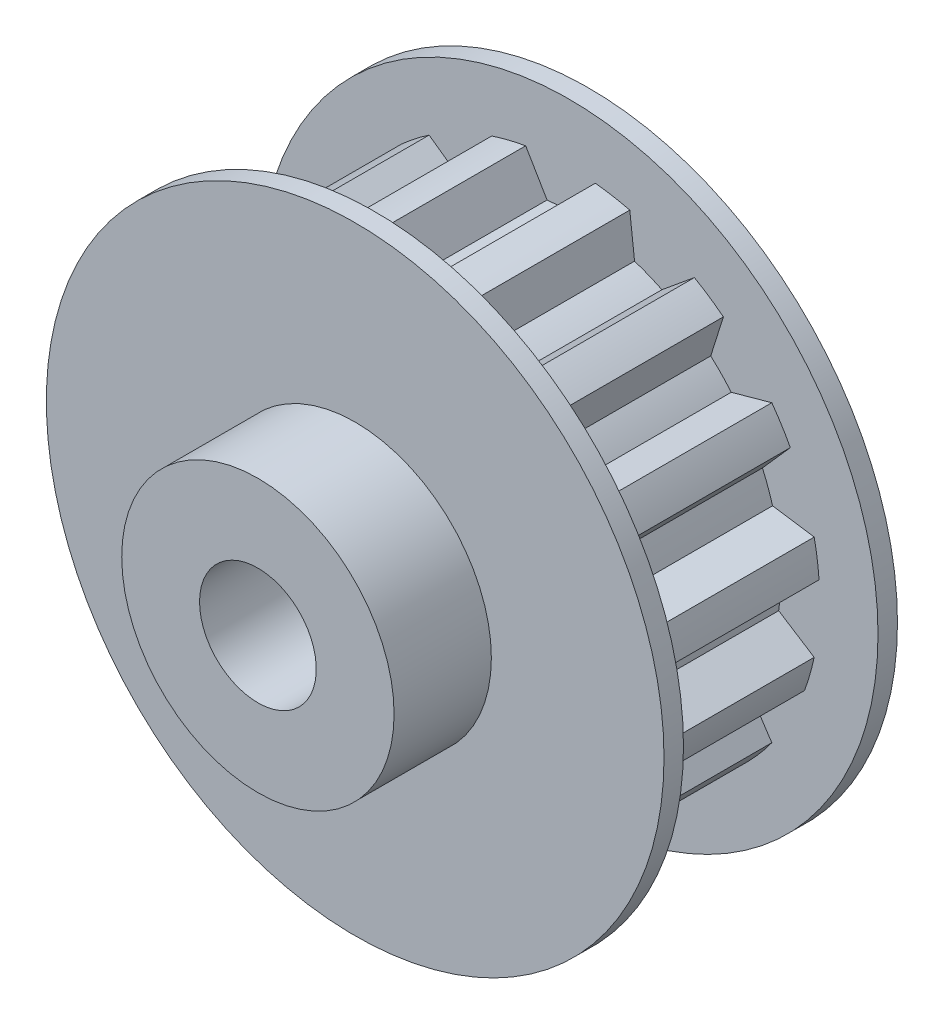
ISO-10303-21;
HEADER;
FILE_DESCRIPTION(('STEP AP214'),'2;1');
FILE_NAME('part.step','',(''),(''),'','','');
FILE_SCHEMA(('AUTOMOTIVE_DESIGN { 1 0 10303 214 1 1 1 1 }'));
ENDSEC;
DATA;
#1=APPLICATION_CONTEXT('core data for automotive mechanical design processes');
#2=APPLICATION_PROTOCOL_DEFINITION('international standard','automotive_design',2000,#1);
#3=PRODUCT_CONTEXT('',#1,'mechanical');
#4=PRODUCT('Part','Part','',(#3));
#5=PRODUCT_RELATED_PRODUCT_CATEGORY('part','',(#4));
#6=PRODUCT_DEFINITION_FORMATION('','',#4);
#7=PRODUCT_DEFINITION_CONTEXT('part definition',#1,'design');
#8=PRODUCT_DEFINITION('design','',#6,#7);
#9=PRODUCT_DEFINITION_SHAPE('','',#8);
#10=(LENGTH_UNIT() NAMED_UNIT(*) SI_UNIT(.MILLI.,.METRE.));
#11=(NAMED_UNIT(*) PLANE_ANGLE_UNIT() SI_UNIT($,.RADIAN.));
#12=(NAMED_UNIT(*) SI_UNIT($,.STERADIAN.) SOLID_ANGLE_UNIT());
#13=UNCERTAINTY_MEASURE_WITH_UNIT(LENGTH_MEASURE(1.E-05),#10,'distance_accuracy_value','');
#14=(GEOMETRIC_REPRESENTATION_CONTEXT(3) GLOBAL_UNCERTAINTY_ASSIGNED_CONTEXT((#13)) GLOBAL_UNIT_ASSIGNED_CONTEXT((#10,
#11,#12)) REPRESENTATION_CONTEXT('',''));
#15=CARTESIAN_POINT('',(0.,0.,0.));
#16=DIRECTION('',(0.,0.,1.));
#17=DIRECTION('',(1.,0.,0.));
#18=AXIS2_PLACEMENT_3D('',#15,#16,#17);
#19=CARTESIAN_POINT('',(0.,0.,12.));
#20=DIRECTION('',(0.,0.,1.));
#21=DIRECTION('',(1.,0.,0.));
#22=AXIS2_PLACEMENT_3D('',#19,#20,#21);
#23=PLANE('',#22);
#24=CARTESIAN_POINT('',(0.,0.,12.));
#25=DIRECTION('',(0.,0.,1.));
#26=DIRECTION('',(1.,0.,0.));
#27=AXIS2_PLACEMENT_3D('',#24,#25,#26);
#28=CIRCLE('',#27,15.875);
#29=CARTESIAN_POINT('',(15.875,0.,12.));
#30=VERTEX_POINT('',#29);
#31=EDGE_CURVE('E467',#30,#30,#28,.T.);
#32=ORIENTED_EDGE('',*,*,#31,.T.);
#33=EDGE_LOOP('',(#32));
#34=FACE_BOUND('',#33,.T.);
#35=CARTESIAN_POINT('',(0.,0.,12.));
#36=DIRECTION('',(0.,0.,1.));
#37=DIRECTION('',(1.,0.,0.));
#38=AXIS2_PLACEMENT_3D('',#35,#36,#37);
#39=CIRCLE('',#38,7.);
#40=CARTESIAN_POINT('',(7.,0.,12.));
#41=VERTEX_POINT('',#40);
#42=EDGE_CURVE('E1381',#41,#41,#39,.T.);
#43=ORIENTED_EDGE('',*,*,#42,.F.);
#44=EDGE_LOOP('',(#43));
#45=FACE_BOUND('',#44,.T.);
#46=ADVANCED_FACE('F35',(#34,#45),#23,.T.);
#47=CARTESIAN_POINT('',(0.,0.,1.));
#48=DIRECTION('',(0.,0.,1.));
#49=DIRECTION('',(1.,0.,0.));
#50=AXIS2_PLACEMENT_3D('',#47,#48,#49);
#51=PLANE('',#50);
#52=CARTESIAN_POINT('',(0.,0.,1.));
#53=DIRECTION('',(0.,0.,1.));
#54=DIRECTION('',(1.,0.,0.));
#55=AXIS2_PLACEMENT_3D('',#52,#53,#54);
#56=CIRCLE('',#55,15.875);
#57=CARTESIAN_POINT('',(15.875,0.,1.));
#58=VERTEX_POINT('',#57);
#59=EDGE_CURVE('E11',#58,#58,#56,.T.);
#60=ORIENTED_EDGE('',*,*,#59,.T.);
#61=EDGE_LOOP('',(#60));
#62=FACE_BOUND('',#61,.T.);
#63=DIRECTION('',(0.909794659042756,0.415058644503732,0.));
#64=VECTOR('',#63,1.);
#65=CARTESIAN_POINT('',(10.875,0.,1.));
#66=LINE('',#65,#64);
#67=CARTESIAN_POINT('',(10.875,0.,1.));
#68=VERTEX_POINT('',#67);
#69=CARTESIAN_POINT('',(12.8436371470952,0.898114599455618,1.));
#70=VERTEX_POINT('',#69);
#71=EDGE_CURVE('E466',#68,#70,#66,.T.);
#72=ORIENTED_EDGE('',*,*,#71,.F.);
#73=CARTESIAN_POINT('',(0.,0.,1.));
#74=DIRECTION('',(0.,0.,1.));
#75=DIRECTION('',(1.,0.,0.));
#76=AXIS2_PLACEMENT_3D('',#73,#74,#75);
#77=CIRCLE('',#76,10.875);
#78=CARTESIAN_POINT('',(10.7691652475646,-1.51350747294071,1.));
#79=VERTEX_POINT('',#78);
#80=EDGE_CURVE('E462',#79,#68,#77,.T.);
#81=ORIENTED_EDGE('',*,*,#80,.F.);
#82=DIRECTION('',(-0.843175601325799,0.537638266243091,0.));
#83=VECTOR('',#82,1.);
#84=CARTESIAN_POINT('',(12.5936503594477,-2.67686301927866,1.));
#85=LINE('',#84,#83);
#86=CARTESIAN_POINT('',(12.5936503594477,-2.67686301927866,1.));
#87=VERTEX_POINT('',#86);
#88=EDGE_CURVE('E240',#87,#79,#85,.T.);
#89=ORIENTED_EDGE('',*,*,#88,.F.);
#90=CARTESIAN_POINT('',(0.,0.,1.));
#91=DIRECTION('',(0.,0.,1.));
#92=DIRECTION('',(1.,0.,0.));
#93=AXIS2_PLACEMENT_3D('',#90,#91,#92);
#94=CIRCLE('',#93,12.875);
#95=CARTESIAN_POINT('',(12.0985424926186,-4.403509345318,1.));
#96=VERTEX_POINT('',#95);
#97=EDGE_CURVE('E637',#96,#87,#94,.T.);
#98=ORIENTED_EDGE('',*,*,#97,.F.);
#99=DIRECTION('',(0.999958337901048,0.00912811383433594,0.));
#100=VECTOR('',#99,1.);
#101=CARTESIAN_POINT('',(9.93480685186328,-4.42326099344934,1.));
#102=LINE('',#101,#100);
#103=CARTESIAN_POINT('',(9.93480685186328,-4.42326099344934,1.));
#104=VERTEX_POINT('',#103);
#105=EDGE_CURVE('E634',#104,#96,#102,.T.);
#106=ORIENTED_EDGE('',*,*,#105,.F.);
#107=CARTESIAN_POINT('',(0.,0.,1.));
#108=DIRECTION('',(0.,0.,1.));
#109=DIRECTION('',(1.,0.,0.));
#110=AXIS2_PLACEMENT_3D('',#107,#108,#109);
#111=CIRCLE('',#110,10.875);
#112=CARTESIAN_POINT('',(9.22252304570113,-5.76287199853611,1.));
#113=VERTEX_POINT('',#112);
#114=EDGE_CURVE('E426',#113,#104,#111,.T.);
#115=ORIENTED_EDGE('',*,*,#114,.F.);
#116=DIRECTION('',(-0.551602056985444,0.834107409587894,0.));
#117=VECTOR('',#116,1.);
#118=CARTESIAN_POINT('',(10.4160938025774,-7.5677351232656,1.));
#119=LINE('',#118,#117);
#120=CARTESIAN_POINT('',(10.4160938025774,-7.56773512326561,1.));
#121=VERTEX_POINT('',#120);
#122=EDGE_CURVE('E629',#121,#113,#119,.T.);
#123=ORIENTED_EDGE('',*,*,#122,.F.);
#124=CARTESIAN_POINT('',(0.,0.,1.));
#125=DIRECTION('',(0.,0.,1.));
#126=DIRECTION('',(1.,0.,0.));
#127=AXIS2_PLACEMENT_3D('',#124,#125,#126);
#128=CIRCLE('',#127,12.875);
#129=CARTESIAN_POINT('',(9.26149992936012,-8.94372651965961,1.));
#130=VERTEX_POINT('',#129);
#131=EDGE_CURVE('E626',#130,#121,#128,.T.);
#132=ORIENTED_EDGE('',*,*,#131,.F.);
#133=DIRECTION('',(0.917220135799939,-0.398380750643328,0.));
#134=VECTOR('',#133,1.);
#135=CARTESIAN_POINT('',(7.27679534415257,-8.08169997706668,1.));
#136=LINE('',#135,#134);
#137=CARTESIAN_POINT('',(7.27679534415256,-8.08169997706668,1.));
#138=VERTEX_POINT('',#137);
#139=EDGE_CURVE('E623',#138,#130,#136,.T.);
#140=ORIENTED_EDGE('',*,*,#139,.F.);
#141=CARTESIAN_POINT('',(0.,0.,1.));
#142=DIRECTION('',(0.,0.,1.));
#143=DIRECTION('',(1.,0.,0.));
#144=AXIS2_PLACEMENT_3D('',#141,#142,#143);
#145=CIRCLE('',#144,10.875);
#146=CARTESIAN_POINT('',(6.08122282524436,-9.01578360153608,1.));
#147=VERTEX_POINT('',#146);
#148=EDGE_CURVE('E620',#147,#138,#145,.T.);
#149=ORIENTED_EDGE('',*,*,#148,.F.);
#150=DIRECTION('',(-0.164651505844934,0.986351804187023,0.));
#151=VECTOR('',#150,1.);
#152=CARTESIAN_POINT('',(6.4375,-11.1500770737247,1.));
#153=LINE('',#152,#151);
#154=CARTESIAN_POINT('',(6.4375,-11.1500770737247,1.));
#155=VERTEX_POINT('',#154);
#156=EDGE_CURVE('E617',#155,#147,#153,.T.);
#157=ORIENTED_EDGE('',*,*,#156,.F.);
#158=CARTESIAN_POINT('',(0.,0.,1.));
#159=DIRECTION('',(0.,0.,1.));
#160=DIRECTION('',(1.,0.,0.));
#161=AXIS2_PLACEMENT_3D('',#158,#159,#160);
#162=CIRCLE('',#161,12.875);
#163=CARTESIAN_POINT('',(4.82305989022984,-11.9374921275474,1.));
#164=VERTEX_POINT('',#163);
#165=EDGE_CURVE('E614',#164,#155,#162,.T.);
#166=ORIENTED_EDGE('',*,*,#165,.F.);
#167=DIRECTION('',(0.675886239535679,-0.737005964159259,0.));
#168=VECTOR('',#167,1.);
#169=CARTESIAN_POINT('',(3.36055981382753,-10.3427396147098,1.));
#170=LINE('',#169,#168);
#171=CARTESIAN_POINT('',(3.36055981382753,-10.3427396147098,1.));
#172=VERTEX_POINT('',#171);
#173=EDGE_CURVE('E611',#172,#164,#170,.T.);
#174=ORIENTED_EDGE('',*,*,#173,.F.);
#175=CARTESIAN_POINT('',(0.,0.,1.));
#176=DIRECTION('',(0.,0.,1.));
#177=DIRECTION('',(1.,0.,0.));
#178=AXIS2_PLACEMENT_3D('',#175,#176,#177);
#179=CIRCLE('',#178,10.875);
#180=CARTESIAN_POINT('',(1.88842393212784,-10.7097843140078,1.));
#181=VERTEX_POINT('',#180);
#182=EDGE_CURVE('E608',#181,#172,#179,.T.);
#183=ORIENTED_EDGE('',*,*,#182,.F.);
#184=DIRECTION('',(0.250768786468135,0.968047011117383,0.));
#185=VECTOR('',#184,1.);
#186=CARTESIAN_POINT('',(1.345803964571,-12.8044694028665,1.));
#187=LINE('',#186,#185);
#188=CARTESIAN_POINT('',(1.345803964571,-12.8044694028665,1.));
#189=VERTEX_POINT('',#188);
#190=EDGE_CURVE('E605',#189,#181,#187,.T.);
#191=ORIENTED_EDGE('',*,*,#190,.F.);
#192=CARTESIAN_POINT('',(0.,0.,1.));
#193=DIRECTION('',(0.,0.,1.));
#194=DIRECTION('',(1.,0.,0.));
#195=AXIS2_PLACEMENT_3D('',#192,#193,#194);
#196=CIRCLE('',#195,12.875);
#197=CARTESIAN_POINT('',(-0.449331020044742,-12.8671568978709,1.));
#198=VERTEX_POINT('',#197);
#199=EDGE_CURVE('E602',#198,#189,#196,.T.);
#200=ORIENTED_EDGE('',*,*,#199,.F.);
#201=DIRECTION('',(0.317685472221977,-0.948196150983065,0.));
#202=VECTOR('',#201,1.);
#203=CARTESIAN_POINT('',(-1.13674703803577,-10.81542561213,1.));
#204=LINE('',#203,#202);
#205=CARTESIAN_POINT('',(-1.13674703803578,-10.81542561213,1.));
#206=VERTEX_POINT('',#205);
#207=EDGE_CURVE('E599',#206,#198,#204,.T.);
#208=ORIENTED_EDGE('',*,*,#207,.F.);
#209=CARTESIAN_POINT('',(0.,0.,1.));
#210=DIRECTION('',(0.,0.,1.));
#211=DIRECTION('',(1.,0.,0.));
#212=AXIS2_PLACEMENT_3D('',#209,#210,#211);
#213=CIRCLE('',#212,10.875);
#214=CARTESIAN_POINT('',(-2.63090061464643,-10.5519660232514,1.));
#215=VERTEX_POINT('',#214);
#216=EDGE_CURVE('E596',#215,#206,#213,.T.);
#217=ORIENTED_EDGE('',*,*,#216,.F.);
#218=DIRECTION('',(0.622828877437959,0.78235809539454,0.));
#219=VECTOR('',#218,1.);
#220=CARTESIAN_POINT('',(-3.97859380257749,-12.2448526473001,1.));
#221=LINE('',#220,#219);
#222=CARTESIAN_POINT('',(-3.97859380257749,-12.2448526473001,1.));
#223=VERTEX_POINT('',#222);
#224=EDGE_CURVE('E593',#223,#215,#221,.T.);
#225=ORIENTED_EDGE('',*,*,#224,.F.);
#226=CARTESIAN_POINT('',(0.,0.,1.));
#227=DIRECTION('',(0.,0.,1.));
#228=DIRECTION('',(1.,0.,0.));
#229=AXIS2_PLACEMENT_3D('',#226,#227,#228);
#230=CIRCLE('',#229,12.875);
#231=CARTESIAN_POINT('',(-5.64402851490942,-11.5719733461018,1.));
#232=VERTEX_POINT('',#231);
#233=EDGE_CURVE('E590',#232,#223,#230,.T.);
#234=ORIENTED_EDGE('',*,*,#233,.F.);
#235=DIRECTION('',(-0.0954459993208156,-0.995434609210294,0.));
#236=VECTOR('',#235,1.);
#237=CARTESIAN_POINT('',(-5.4375,-9.41802626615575,1.));
#238=LINE('',#237,#236);
#239=CARTESIAN_POINT('',(-5.4375,-9.41802626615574,1.));
#240=VERTEX_POINT('',#239);
#241=EDGE_CURVE('E587',#240,#232,#238,.T.);
#242=ORIENTED_EDGE('',*,*,#241,.F.);
#243=CARTESIAN_POINT('',(0.,0.,1.));
#244=DIRECTION('',(0.,0.,1.));
#245=DIRECTION('',(1.,0.,0.));
#246=AXIS2_PLACEMENT_3D('',#243,#244,#245);
#247=CIRCLE('',#246,10.875);
#248=CARTESIAN_POINT('',(-6.69531854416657,-8.56961694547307,1.));
#249=VERTEX_POINT('',#248);
#250=EDGE_CURVE('E584',#249,#240,#247,.T.);
#251=ORIENTED_EDGE('',*,*,#250,.F.);
#252=DIRECTION('',(0.88719619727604,0.461392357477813,0.));
#253=VECTOR('',#252,1.);
#254=CARTESIAN_POINT('',(-8.61505655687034,-9.56798962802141,1.));
#255=LINE('',#254,#253);
#256=CARTESIAN_POINT('',(-8.61505655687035,-9.56798962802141,1.));
#257=VERTEX_POINT('',#256);
#258=EDGE_CURVE('E581',#257,#249,#255,.T.);
#259=ORIENTED_EDGE('',*,*,#258,.F.);
#260=CARTESIAN_POINT('',(0.,0.,1.));
#261=DIRECTION('',(0.,0.,1.));
#262=DIRECTION('',(1.,0.,0.));
#263=AXIS2_PLACEMENT_3D('',#260,#261,#262);
#264=CIRCLE('',#263,12.875);
#265=CARTESIAN_POINT('',(-9.86282220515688,-8.27589047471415,1.));
#266=VERTEX_POINT('',#265);
#267=EDGE_CURVE('E578',#266,#257,#264,.T.);
#268=ORIENTED_EDGE('',*,*,#267,.F.);
#269=DIRECTION('',(-0.492073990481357,-0.870553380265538,0.));
#270=VECTOR('',#269,1.);
#271=CARTESIAN_POINT('',(-8.79805981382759,-6.3921646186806,1.));
#272=LINE('',#271,#270);
#273=CARTESIAN_POINT('',(-8.79805981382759,-6.3921646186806,1.));
#274=VERTEX_POINT('',#273);
#275=EDGE_CURVE('E575',#274,#266,#272,.T.);
#276=ORIENTED_EDGE('',*,*,#275,.F.);
#277=CARTESIAN_POINT('',(0.,0.,1.));
#278=DIRECTION('',(0.,0.,1.));
#279=DIRECTION('',(1.,0.,0.));
#280=AXIS2_PLACEMENT_3D('',#277,#278,#279);
#281=CIRCLE('',#280,10.875);
#282=CARTESIAN_POINT('',(-9.60205507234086,-5.10550324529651,1.));
#283=VERTEX_POINT('',#282);
#284=EDGE_CURVE('E572',#283,#274,#281,.T.);
#285=ORIENTED_EDGE('',*,*,#284,.F.);
#286=DIRECTION('',(0.99815923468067,0.0606476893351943,0.));
#287=VECTOR('',#286,1.);
#288=CARTESIAN_POINT('',(-11.7618977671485,-5.23673427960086,1.));
#289=LINE('',#288,#287);
#290=CARTESIAN_POINT('',(-11.7618977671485,-5.23673427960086,1.));
#291=VERTEX_POINT('',#290);
#292=EDGE_CURVE('E569',#291,#283,#289,.T.);
#293=ORIENTED_EDGE('',*,*,#292,.F.);
#294=CARTESIAN_POINT('',(0.,0.,1.));
#295=DIRECTION('',(0.,0.,1.));
#296=DIRECTION('',(1.,0.,0.));
#297=AXIS2_PLACEMENT_3D('',#294,#295,#296);
#298=CIRCLE('',#297,12.875);
#299=CARTESIAN_POINT('',(-12.3762443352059,-3.54883095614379,1.));
#300=VERTEX_POINT('',#299);
#301=EDGE_CURVE('E566',#300,#291,#298,.T.);
#302=ORIENTED_EDGE('',*,*,#301,.F.);
#303=DIRECTION('',(-0.803617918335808,-0.595145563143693,0.));
#304=VECTOR('',#303,1.);
#305=CARTESIAN_POINT('',(-10.6373551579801,-2.26103963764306,1.));
#306=LINE('',#305,#304);
#307=CARTESIAN_POINT('',(-10.6373551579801,-2.26103963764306,1.));
#308=VERTEX_POINT('',#307);
#309=EDGE_CURVE('E563',#308,#300,#306,.T.);
#310=ORIENTED_EDGE('',*,*,#309,.F.);
#311=CARTESIAN_POINT('',(0.,0.,1.));
#312=DIRECTION('',(0.,0.,1.));
#313=DIRECTION('',(1.,0.,0.));
#314=AXIS2_PLACEMENT_3D('',#311,#312,#313);
#315=CIRCLE('',#314,10.875);
#316=CARTESIAN_POINT('',(-10.8485090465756,-0.758601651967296,1.));
#317=VERTEX_POINT('',#316);
#318=EDGE_CURVE('E560',#317,#308,#315,.T.);
#319=ORIENTED_EDGE('',*,*,#318,.F.);
#320=DIRECTION('',(0.936531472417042,-0.350583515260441,0.));
#321=VECTOR('',#320,1.);
#322=CARTESIAN_POINT('',(-12.875,0.,1.));
#323=LINE('',#322,#321);
#324=CARTESIAN_POINT('',(-12.875,0.,1.));
#325=VERTEX_POINT('',#324);
#326=EDGE_CURVE('E557',#325,#317,#323,.T.);
#327=ORIENTED_EDGE('',*,*,#326,.F.);
#328=CARTESIAN_POINT('',(0.,0.,1.));
#329=DIRECTION('',(0.,0.,1.));
#330=DIRECTION('',(1.,0.,0.));
#331=AXIS2_PLACEMENT_3D('',#328,#329,#330);
#332=CIRCLE('',#331,12.875);
#333=CARTESIAN_POINT('',(-12.7497013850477,1.79185367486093,1.));
#334=VERTEX_POINT('',#333);
#335=EDGE_CURVE('E554',#334,#325,#332,.T.);
#336=ORIENTED_EDGE('',*,*,#335,.F.);
#337=DIRECTION('',(-0.976209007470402,-0.216831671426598,0.));
#338=VECTOR('',#337,1.);
#339=CARTESIAN_POINT('',(-10.6373551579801,2.26103963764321,1.));
#340=LINE('',#339,#338);
#341=CARTESIAN_POINT('',(-10.6373551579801,2.26103963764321,1.));
#342=VERTEX_POINT('',#341);
#343=EDGE_CURVE('E551',#342,#334,#340,.T.);
#344=ORIENTED_EDGE('',*,*,#343,.F.);
#345=CARTESIAN_POINT('',(0.,0.,1.));
#346=DIRECTION('',(0.,0.,1.));
#347=DIRECTION('',(1.,0.,0.));
#348=AXIS2_PLACEMENT_3D('',#345,#346,#347);
#349=CIRCLE('',#348,10.875);
#350=CARTESIAN_POINT('',(-10.2191572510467,3.71946905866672,1.));
#351=VERTEX_POINT('',#350);
#352=EDGE_CURVE('E548',#351,#342,#349,.T.);
#353=ORIENTED_EDGE('',*,*,#352,.F.);
#354=DIRECTION('',(0.712968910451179,-0.701195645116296,0.));
#355=VECTOR('',#354,1.);
#356=CARTESIAN_POINT('',(-11.7618977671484,5.23673427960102,1.));
#357=LINE('',#356,#355);
#358=CARTESIAN_POINT('',(-11.7618977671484,5.23673427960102,1.));
#359=VERTEX_POINT('',#358);
#360=EDGE_CURVE('E545',#359,#351,#357,.T.);
#361=ORIENTED_EDGE('',*,*,#360,.F.);
#362=CARTESIAN_POINT('',(0.,0.,1.));
#363=DIRECTION('',(0.,0.,1.));
#364=DIRECTION('',(1.,0.,0.));
#365=AXIS2_PLACEMENT_3D('',#362,#363,#364);
#366=CIRCLE('',#365,12.875);
#367=CARTESIAN_POINT('',(-10.9186192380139,6.8227105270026,1.));
#368=VERTEX_POINT('',#367);
#369=EDGE_CURVE('E542',#368,#359,#366,.T.);
#370=ORIENTED_EDGE('',*,*,#369,.F.);
#371=DIRECTION('',(-0.980004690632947,0.19897438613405,0.));
#372=VECTOR('',#371,1.);
#373=CARTESIAN_POINT('',(-8.7980598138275,6.39216461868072,1.));
#374=LINE('',#373,#372);
#375=CARTESIAN_POINT('',(-8.7980598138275,6.39216461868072,1.));
#376=VERTEX_POINT('',#375);
#377=EDGE_CURVE('E539',#376,#368,#374,.T.);
#378=ORIENTED_EDGE('',*,*,#377,.F.);
#379=CARTESIAN_POINT('',(0.,0.,1.));
#380=DIRECTION('',(0.,0.,1.));
#381=DIRECTION('',(1.,0.,0.));
#382=AXIS2_PLACEMENT_3D('',#379,#380,#381);
#383=CIRCLE('',#382,10.875);
#384=CARTESIAN_POINT('',(-7.82282032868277,7.55440977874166,1.));
#385=VERTEX_POINT('',#384);
#386=EDGE_CURVE('E536',#385,#376,#383,.T.);
#387=ORIENTED_EDGE('',*,*,#386,.F.);
#388=DIRECTION('',(0.366127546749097,-0.930564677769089,0.));
#389=VECTOR('',#388,1.);
#390=CARTESIAN_POINT('',(-8.61505655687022,9.56798962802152,1.));
#391=LINE('',#390,#389);
#392=CARTESIAN_POINT('',(-8.61505655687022,9.56798962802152,1.));
#393=VERTEX_POINT('',#392);
#394=EDGE_CURVE('E533',#393,#385,#391,.T.);
#395=ORIENTED_EDGE('',*,*,#394,.F.);
#396=CARTESIAN_POINT('',(0.,0.,1.));
#397=DIRECTION('',(0.,0.,1.));
#398=DIRECTION('',(1.,0.,0.));
#399=AXIS2_PLACEMENT_3D('',#396,#397,#398);
#400=CIRCLE('',#399,12.875);
#401=CARTESIAN_POINT('',(-7.19960863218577,10.6738587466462,1.));
#402=VERTEX_POINT('',#401);
#403=EDGE_CURVE('E530',#402,#393,#400,.T.);
#404=ORIENTED_EDGE('',*,*,#403,.F.);
#405=DIRECTION('',(-0.814348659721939,0.58037596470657,0.));
#406=VECTOR('',#405,1.);
#407=CARTESIAN_POINT('',(-5.43749999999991,9.41802626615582,1.));
#408=LINE('',#407,#406);
#409=CARTESIAN_POINT('',(-5.43749999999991,9.41802626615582,1.));
#410=VERTEX_POINT('',#409);
#411=EDGE_CURVE('E527',#410,#402,#408,.T.);
#412=ORIENTED_EDGE('',*,*,#411,.F.);
#413=CARTESIAN_POINT('',(0.,0.,1.));
#414=DIRECTION('',(0.,0.,1.));
#415=DIRECTION('',(1.,0.,0.));
#416=AXIS2_PLACEMENT_3D('',#413,#414,#415);
#417=CIRCLE('',#416,10.875);
#418=CARTESIAN_POINT('',(-4.07384670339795,10.0831244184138,1.));
#419=VERTEX_POINT('',#418);
#420=EDGE_CURVE('E524',#419,#410,#417,.T.);
#421=ORIENTED_EDGE('',*,*,#420,.F.);
#422=DIRECTION('',(-0.0440205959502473,-0.999030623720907,0.));
#423=VECTOR('',#422,1.);
#424=CARTESIAN_POINT('',(-3.97859380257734,12.2448526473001,1.));
#425=LINE('',#424,#423);
#426=CARTESIAN_POINT('',(-3.97859380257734,12.2448526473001,1.));
#427=VERTEX_POINT('',#426);
#428=EDGE_CURVE('E521',#427,#419,#425,.T.);
#429=ORIENTED_EDGE('',*,*,#428,.F.);
#430=CARTESIAN_POINT('',(0.,0.,1.));
#431=DIRECTION('',(0.,0.,1.));
#432=DIRECTION('',(1.,0.,0.));
#433=AXIS2_PLACEMENT_3D('',#430,#431,#432);
#434=CIRCLE('',#433,12.875);
#435=CARTESIAN_POINT('',(-2.23572028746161,12.6793998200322,1.));
#436=VERTEX_POINT('',#435);
#437=EDGE_CURVE('E518',#436,#427,#434,.T.);
#438=ORIENTED_EDGE('',*,*,#437,.F.);
#439=DIRECTION('',(-0.507884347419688,0.861425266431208,0.));
#440=VECTOR('',#439,1.);
#441=CARTESIAN_POINT('',(-1.13674703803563,10.81542561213,1.));
#442=LINE('',#441,#440);
#443=CARTESIAN_POINT('',(-1.13674703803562,10.81542561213,1.));
#444=VERTEX_POINT('',#443);
#445=EDGE_CURVE('E515',#444,#436,#442,.T.);
#446=ORIENTED_EDGE('',*,*,#445,.F.);
#447=CARTESIAN_POINT('',(0.,0.,1.));
#448=DIRECTION('',(0.,0.,1.));
#449=DIRECTION('',(1.,0.,0.));
#450=AXIS2_PLACEMENT_3D('',#447,#448,#449);
#451=CIRCLE('',#450,10.875);
#452=CARTESIAN_POINT('',(0.3795320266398,10.8683752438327,1.));
#453=VERTEX_POINT('',#452);
#454=EDGE_CURVE('E512',#453,#444,#451,.T.);
#455=ORIENTED_EDGE('',*,*,#454,.F.);
#456=DIRECTION('',(-0.446557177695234,-0.894755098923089,0.));
#457=VECTOR('',#456,1.);
#458=CARTESIAN_POINT('',(1.34580396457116,12.8044694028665,1.));
#459=LINE('',#458,#457);
#460=CARTESIAN_POINT('',(1.34580396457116,12.8044694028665,1.));
#461=VERTEX_POINT('',#460);
#462=EDGE_CURVE('E509',#461,#453,#459,.T.);
#463=ORIENTED_EDGE('',*,*,#462,.F.);
#464=CARTESIAN_POINT('',(0.,0.,1.));
#465=DIRECTION('',(0.,0.,1.));
#466=DIRECTION('',(1.,0.,0.));
#467=AXIS2_PLACEMENT_3D('',#464,#465,#466);
#468=CIRCLE('',#467,12.875);
#469=CARTESIAN_POINT('',(3.11474440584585,12.4925574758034,1.));
#470=VERTEX_POINT('',#469);
#471=EDGE_CURVE('E506',#470,#461,#468,.T.);
#472=ORIENTED_EDGE('',*,*,#471,.F.);
#473=DIRECTION('',(-0.113602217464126,0.993526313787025,0.));
#474=VECTOR('',#473,1.);
#475=CARTESIAN_POINT('',(3.36055981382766,10.3427396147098,1.));
#476=LINE('',#475,#474);
#477=CARTESIAN_POINT('',(3.36055981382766,10.3427396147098,1.));
#478=VERTEX_POINT('',#477);
#479=EDGE_CURVE('E503',#478,#470,#476,.T.);
#480=ORIENTED_EDGE('',*,*,#479,.F.);
#481=CARTESIAN_POINT('',(0.,0.,1.));
#482=DIRECTION('',(0.,0.,1.));
#483=DIRECTION('',(1.,0.,0.));
#484=AXIS2_PLACEMENT_3D('',#481,#482,#483);
#485=CIRCLE('',#484,10.875);
#486=CARTESIAN_POINT('',(4.76728622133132,9.77438525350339,1.));
#487=VERTEX_POINT('',#486);
#488=EDGE_CURVE('E500',#487,#478,#485,.T.);
#489=ORIENTED_EDGE('',*,*,#488,.F.);
#490=DIRECTION('',(-0.771879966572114,-0.63576828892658,0.));
#491=VECTOR('',#490,1.);
#492=CARTESIAN_POINT('',(6.43750000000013,11.1500770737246,1.));
#493=LINE('',#492,#491);
#494=CARTESIAN_POINT('',(6.43750000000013,11.1500770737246,1.));
#495=VERTEX_POINT('',#494);
#496=EDGE_CURVE('E497',#495,#487,#493,.T.);
#497=ORIENTED_EDGE('',*,*,#496,.F.);
#498=CARTESIAN_POINT('',(0.,0.,1.));
#499=DIRECTION('',(0.,0.,1.));
#500=DIRECTION('',(1.,0.,0.));
#501=AXIS2_PLACEMENT_3D('',#498,#499,#500);
#502=CIRCLE('',#501,12.875);
#503=CARTESIAN_POINT('',(7.92664149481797,10.1456384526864,1.));
#504=VERTEX_POINT('',#503);
#505=EDGE_CURVE('E494',#504,#495,#502,.T.);
#506=ORIENTED_EDGE('',*,*,#505,.F.);
#507=DIRECTION('',(0.300322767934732,0.953837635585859,0.));
#508=VECTOR('',#507,1.);
#509=CARTESIAN_POINT('',(7.27679534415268,8.08169997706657,1.));
#510=LINE('',#509,#508);
#511=CARTESIAN_POINT('',(7.27679534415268,8.08169997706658,1.));
#512=VERTEX_POINT('',#511);
#513=EDGE_CURVE('E491',#512,#504,#510,.T.);
#514=ORIENTED_EDGE('',*,*,#513,.F.);
#515=CARTESIAN_POINT('',(0.,0.,1.));
#516=DIRECTION('',(0.,0.,1.));
#517=DIRECTION('',(1.,0.,0.));
#518=AXIS2_PLACEMENT_3D('',#515,#516,#517);
#519=CIRCLE('',#518,10.875);
#520=CARTESIAN_POINT('',(8.33073331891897,6.99031525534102,1.));
#521=VERTEX_POINT('',#520);
#522=EDGE_CURVE('E488',#521,#512,#519,.T.);
#523=ORIENTED_EDGE('',*,*,#522,.F.);
#524=DIRECTION('',(-0.963737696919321,-0.266851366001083,0.));
#525=VECTOR('',#524,1.);
#526=CARTESIAN_POINT('',(10.4160938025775,7.56773512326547,1.));
#527=LINE('',#526,#525);
#528=CARTESIAN_POINT('',(10.4160938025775,7.56773512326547,1.));
#529=VERTEX_POINT('',#528);
#530=EDGE_CURVE('E485',#529,#521,#527,.T.);
#531=ORIENTED_EDGE('',*,*,#530,.F.);
#532=CARTESIAN_POINT('',(0.,0.,1.));
#533=DIRECTION('',(0.,0.,1.));
#534=DIRECTION('',(1.,0.,0.));
#535=AXIS2_PLACEMENT_3D('',#532,#533,#534);
#536=CIRCLE('',#535,12.875);
#537=CARTESIAN_POINT('',(11.3679502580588,6.04444637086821,1.));
#538=VERTEX_POINT('',#537);
#539=EDGE_CURVE('E482',#538,#529,#536,.T.);
#540=ORIENTED_EDGE('',*,*,#539,.F.);
#541=DIRECTION('',(0.662319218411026,0.749221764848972,0.));
#542=VECTOR('',#541,1.);
#543=CARTESIAN_POINT('',(9.93480685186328,4.42326099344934,1.));
#544=LINE('',#543,#542);
#545=CARTESIAN_POINT('',(9.93480685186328,4.42326099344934,1.));
#546=VERTEX_POINT('',#545);
#547=EDGE_CURVE('E479',#546,#538,#544,.T.);
#548=ORIENTED_EDGE('',*,*,#547,.F.);
#549=CARTESIAN_POINT('',(0.,0.,1.));
#550=DIRECTION('',(0.,0.,1.));
#551=DIRECTION('',(1.,0.,0.));
#552=AXIS2_PLACEMENT_3D('',#549,#550,#551);
#553=CIRCLE('',#552,10.875);
#554=CARTESIAN_POINT('',(10.4537209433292,2.99755624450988,1.));
#555=VERTEX_POINT('',#554);
#556=EDGE_CURVE('E476',#555,#546,#553,.T.);
#557=ORIENTED_EDGE('',*,*,#556,.F.);
#558=DIRECTION('',(-0.988956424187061,0.148206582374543,0.));
#559=VECTOR('',#558,1.);
#560=CARTESIAN_POINT('',(12.5936503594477,2.67686301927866,1.));
#561=LINE('',#560,#559);
#562=CARTESIAN_POINT('',(12.5936503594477,2.67686301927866,1.));
#563=VERTEX_POINT('',#562);
#564=EDGE_CURVE('E473',#563,#555,#561,.T.);
#565=ORIENTED_EDGE('',*,*,#564,.F.);
#566=CARTESIAN_POINT('',(0.,0.,1.));
#567=DIRECTION('',(0.,0.,1.));
#568=DIRECTION('',(1.,0.,0.));
#569=AXIS2_PLACEMENT_3D('',#566,#567,#568);
#570=CIRCLE('',#569,12.875);
#571=EDGE_CURVE('E470',#70,#563,#570,.T.);
#572=ORIENTED_EDGE('',*,*,#571,.F.);
#573=EDGE_LOOP('',(#72,#81,#89,#98,#106,#115,#123,#132,#140,#149,#157,#166,#174,#183,#191,#200,
#208,#217,#225,#234,#242,#251,#259,#268,#276,#285,#293,#302,#310,#319,#327,#336,#344,#353,#361,
#370,#378,#387,#395,#404,#412,#421,#429,#438,#446,#455,#463,#472,#480,#489,#497,#506,#514,#523,
#531,#540,#548,#557,#565,#572));
#574=FACE_BOUND('',#573,.T.);
#575=ADVANCED_FACE('F887',(#62,#574),#51,.T.);
#576=CARTESIAN_POINT('',(0.,0.,1.));
#577=DIRECTION('',(0.,0.,-1.));
#578=DIRECTION('',(-1.,0.,0.));
#579=AXIS2_PLACEMENT_3D('',#576,#577,#578);
#580=CYLINDRICAL_SURFACE('',#579,15.875);
#581=ORIENTED_EDGE('',*,*,#59,.F.);
#582=EDGE_LOOP('',(#581));
#583=FACE_BOUND('',#582,.T.);
#584=CARTESIAN_POINT('',(0.,0.,0.));
#585=DIRECTION('',(0.,0.,1.));
#586=DIRECTION('',(1.,0.,0.));
#587=AXIS2_PLACEMENT_3D('',#584,#585,#586);
#588=CIRCLE('',#587,15.875);
#589=CARTESIAN_POINT('',(15.875,0.,0.));
#590=VERTEX_POINT('',#589);
#591=EDGE_CURVE('E39',#590,#590,#588,.T.);
#592=ORIENTED_EDGE('',*,*,#591,.T.);
#593=EDGE_LOOP('',(#592));
#594=FACE_BOUND('',#593,.T.);
#595=ADVANCED_FACE('F37',(#583,#594),#580,.T.);
#596=CARTESIAN_POINT('',(0.,0.,0.));
#597=DIRECTION('',(0.,0.,1.));
#598=DIRECTION('',(1.,0.,0.));
#599=AXIS2_PLACEMENT_3D('',#596,#597,#598);
#600=PLANE('',#599);
#601=CARTESIAN_POINT('',(0.,0.,0.));
#602=DIRECTION('',(0.,0.,-1.));
#603=DIRECTION('',(-1.,0.,0.));
#604=AXIS2_PLACEMENT_3D('',#601,#602,#603);
#605=CIRCLE('',#604,3.00000000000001);
#606=CARTESIAN_POINT('',(-3.00000000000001,0.,0.));
#607=VERTEX_POINT('',#606);
#608=EDGE_CURVE('E1389',#607,#607,#605,.T.);
#609=ORIENTED_EDGE('',*,*,#608,.F.);
#610=EDGE_LOOP('',(#609));
#611=FACE_BOUND('',#610,.T.);
#612=ORIENTED_EDGE('',*,*,#591,.F.);
#613=EDGE_LOOP('',(#612));
#614=FACE_BOUND('',#613,.T.);
#615=ADVANCED_FACE('F876',(#611,#614),#600,.F.);
#616=CARTESIAN_POINT('',(0.,0.,11.));
#617=DIRECTION('',(0.,0.,-1.));
#618=DIRECTION('',(-1.,0.,0.));
#619=AXIS2_PLACEMENT_3D('',#616,#617,#618);
#620=CYLINDRICAL_SURFACE('',#619,10.875);
#621=ORIENTED_EDGE('',*,*,#80,.T.);
#622=DIRECTION('',(0.,0.,-1.));
#623=VECTOR('',#622,1.);
#624=CARTESIAN_POINT('',(10.875,0.,11.));
#625=LINE('',#624,#623);
#626=CARTESIAN_POINT('',(10.875,0.,11.));
#627=VERTEX_POINT('',#626);
#628=EDGE_CURVE('E866',#627,#68,#625,.T.);
#629=ORIENTED_EDGE('',*,*,#628,.F.);
#630=CARTESIAN_POINT('',(0.,0.,11.));
#631=DIRECTION('',(0.,0.,1.));
#632=DIRECTION('',(1.,0.,0.));
#633=AXIS2_PLACEMENT_3D('',#630,#631,#632);
#634=CIRCLE('',#633,10.875);
#635=CARTESIAN_POINT('',(10.7691652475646,-1.51350747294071,11.));
#636=VERTEX_POINT('',#635);
#637=EDGE_CURVE('E642',#636,#627,#634,.T.);
#638=ORIENTED_EDGE('',*,*,#637,.F.);
#639=DIRECTION('',(0.,0.,-1.));
#640=VECTOR('',#639,1.);
#641=CARTESIAN_POINT('',(10.7691652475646,-1.51350747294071,11.));
#642=LINE('',#641,#640);
#643=EDGE_CURVE('E461',#636,#79,#642,.T.);
#644=ORIENTED_EDGE('',*,*,#643,.T.);
#645=EDGE_LOOP('',(#621,#629,#638,#644));
#646=FACE_BOUND('',#645,.T.);
#647=ADVANCED_FACE('F878',(#646),#620,.T.);
#648=CARTESIAN_POINT('',(10.875,0.,11.));
#649=DIRECTION('',(-0.415058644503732,0.909794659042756,0.));
#650=DIRECTION('',(-0.909794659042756,-0.415058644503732,0.));
#651=AXIS2_PLACEMENT_3D('',#648,#649,#650);
#652=PLANE('',#651);
#653=ORIENTED_EDGE('',*,*,#71,.T.);
#654=DIRECTION('',(0.,0.,-1.));
#655=VECTOR('',#654,1.);
#656=CARTESIAN_POINT('',(12.8436371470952,0.898114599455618,11.));
#657=LINE('',#656,#655);
#658=CARTESIAN_POINT('',(12.8436371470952,0.898114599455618,11.));
#659=VERTEX_POINT('',#658);
#660=EDGE_CURVE('E862',#659,#70,#657,.T.);
#661=ORIENTED_EDGE('',*,*,#660,.F.);
#662=DIRECTION('',(0.909794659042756,0.415058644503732,0.));
#663=VECTOR('',#662,1.);
#664=CARTESIAN_POINT('',(10.875,0.,11.));
#665=LINE('',#664,#663);
#666=EDGE_CURVE('E248',#627,#659,#665,.T.);
#667=ORIENTED_EDGE('',*,*,#666,.F.);
#668=ORIENTED_EDGE('',*,*,#628,.T.);
#669=EDGE_LOOP('',(#653,#661,#667,#668));
#670=FACE_BOUND('',#669,.T.);
#671=ADVANCED_FACE('F884',(#670),#652,.F.);
#672=CARTESIAN_POINT('',(0.,0.,11.));
#673=DIRECTION('',(0.,0.,-1.));
#674=DIRECTION('',(-1.,0.,0.));
#675=AXIS2_PLACEMENT_3D('',#672,#673,#674);
#676=CYLINDRICAL_SURFACE('',#675,12.875);
#677=ORIENTED_EDGE('',*,*,#571,.T.);
#678=DIRECTION('',(0.,0.,-1.));
#679=VECTOR('',#678,1.);
#680=CARTESIAN_POINT('',(12.5936503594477,2.67686301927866,11.));
#681=LINE('',#680,#679);
#682=CARTESIAN_POINT('',(12.5936503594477,2.67686301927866,11.));
#683=VERTEX_POINT('',#682);
#684=EDGE_CURVE('E858',#683,#563,#681,.T.);
#685=ORIENTED_EDGE('',*,*,#684,.F.);
#686=CARTESIAN_POINT('',(0.,0.,11.));
#687=DIRECTION('',(0.,0.,1.));
#688=DIRECTION('',(1.,0.,0.));
#689=AXIS2_PLACEMENT_3D('',#686,#687,#688);
#690=CIRCLE('',#689,12.875);
#691=EDGE_CURVE('E1146',#659,#683,#690,.T.);
#692=ORIENTED_EDGE('',*,*,#691,.F.);
#693=ORIENTED_EDGE('',*,*,#660,.T.);
#694=EDGE_LOOP('',(#677,#685,#692,#693));
#695=FACE_BOUND('',#694,.T.);
#696=ADVANCED_FACE('F1132',(#695),#676,.T.);
#697=CARTESIAN_POINT('',(12.5936503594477,2.67686301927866,11.));
#698=DIRECTION('',(-0.148206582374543,-0.988956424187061,0.));
#699=DIRECTION('',(0.988956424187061,-0.148206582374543,0.));
#700=AXIS2_PLACEMENT_3D('',#697,#698,#699);
#701=PLANE('',#700);
#702=ORIENTED_EDGE('',*,*,#564,.T.);
#703=DIRECTION('',(0.,0.,-1.));
#704=VECTOR('',#703,1.);
#705=CARTESIAN_POINT('',(10.4537209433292,2.99755624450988,11.));
#706=LINE('',#705,#704);
#707=CARTESIAN_POINT('',(10.4537209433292,2.99755624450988,11.));
#708=VERTEX_POINT('',#707);
#709=EDGE_CURVE('E854',#708,#555,#706,.T.);
#710=ORIENTED_EDGE('',*,*,#709,.F.);
#711=DIRECTION('',(-0.988956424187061,0.148206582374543,0.));
#712=VECTOR('',#711,1.);
#713=CARTESIAN_POINT('',(12.5936503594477,2.67686301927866,11.));
#714=LINE('',#713,#712);
#715=EDGE_CURVE('E1159',#683,#708,#714,.T.);
#716=ORIENTED_EDGE('',*,*,#715,.F.);
#717=ORIENTED_EDGE('',*,*,#684,.T.);
#718=EDGE_LOOP('',(#702,#710,#716,#717));
#719=FACE_BOUND('',#718,.T.);
#720=ADVANCED_FACE('F1128',(#719),#701,.F.);
#721=CARTESIAN_POINT('',(0.,0.,11.));
#722=DIRECTION('',(0.,0.,-1.));
#723=DIRECTION('',(-1.,0.,0.));
#724=AXIS2_PLACEMENT_3D('',#721,#722,#723);
#725=CYLINDRICAL_SURFACE('',#724,10.875);
#726=ORIENTED_EDGE('',*,*,#556,.T.);
#727=DIRECTION('',(0.,0.,-1.));
#728=VECTOR('',#727,1.);
#729=CARTESIAN_POINT('',(9.93480685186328,4.42326099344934,11.));
#730=LINE('',#729,#728);
#731=CARTESIAN_POINT('',(9.93480685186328,4.42326099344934,11.));
#732=VERTEX_POINT('',#731);
#733=EDGE_CURVE('E850',#732,#546,#730,.T.);
#734=ORIENTED_EDGE('',*,*,#733,.F.);
#735=CARTESIAN_POINT('',(0.,0.,11.));
#736=DIRECTION('',(0.,0.,1.));
#737=DIRECTION('',(1.,0.,0.));
#738=AXIS2_PLACEMENT_3D('',#735,#736,#737);
#739=CIRCLE('',#738,10.875);
#740=EDGE_CURVE('E1153',#708,#732,#739,.T.);
#741=ORIENTED_EDGE('',*,*,#740,.F.);
#742=ORIENTED_EDGE('',*,*,#709,.T.);
#743=EDGE_LOOP('',(#726,#734,#741,#742));
#744=FACE_BOUND('',#743,.T.);
#745=ADVANCED_FACE('F1124',(#744),#725,.T.);
#746=CARTESIAN_POINT('',(9.93480685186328,4.42326099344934,11.));
#747=DIRECTION('',(-0.749221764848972,0.662319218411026,0.));
#748=DIRECTION('',(-0.662319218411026,-0.749221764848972,0.));
#749=AXIS2_PLACEMENT_3D('',#746,#747,#748);
#750=PLANE('',#749);
#751=ORIENTED_EDGE('',*,*,#547,.T.);
#752=DIRECTION('',(0.,0.,-1.));
#753=VECTOR('',#752,1.);
#754=CARTESIAN_POINT('',(11.3679502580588,6.04444637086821,11.));
#755=LINE('',#754,#753);
#756=CARTESIAN_POINT('',(11.3679502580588,6.04444637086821,11.));
#757=VERTEX_POINT('',#756);
#758=EDGE_CURVE('E846',#757,#538,#755,.T.);
#759=ORIENTED_EDGE('',*,*,#758,.F.);
#760=DIRECTION('',(0.662319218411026,0.749221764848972,0.));
#761=VECTOR('',#760,1.);
#762=CARTESIAN_POINT('',(9.93480685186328,4.42326099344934,11.));
#763=LINE('',#762,#761);
#764=EDGE_CURVE('E1158',#732,#757,#763,.T.);
#765=ORIENTED_EDGE('',*,*,#764,.F.);
#766=ORIENTED_EDGE('',*,*,#733,.T.);
#767=EDGE_LOOP('',(#751,#759,#765,#766));
#768=FACE_BOUND('',#767,.T.);
#769=ADVANCED_FACE('F1120',(#768),#750,.F.);
#770=CARTESIAN_POINT('',(0.,0.,11.));
#771=DIRECTION('',(0.,0.,-1.));
#772=DIRECTION('',(-1.,0.,0.));
#773=AXIS2_PLACEMENT_3D('',#770,#771,#772);
#774=CYLINDRICAL_SURFACE('',#773,12.875);
#775=ORIENTED_EDGE('',*,*,#539,.T.);
#776=DIRECTION('',(0.,0.,-1.));
#777=VECTOR('',#776,1.);
#778=CARTESIAN_POINT('',(10.4160938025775,7.56773512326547,11.));
#779=LINE('',#778,#777);
#780=CARTESIAN_POINT('',(10.4160938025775,7.56773512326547,11.));
#781=VERTEX_POINT('',#780);
#782=EDGE_CURVE('E842',#781,#529,#779,.T.);
#783=ORIENTED_EDGE('',*,*,#782,.F.);
#784=CARTESIAN_POINT('',(0.,0.,11.));
#785=DIRECTION('',(0.,0.,1.));
#786=DIRECTION('',(1.,0.,0.));
#787=AXIS2_PLACEMENT_3D('',#784,#785,#786);
#788=CIRCLE('',#787,12.875);
#789=EDGE_CURVE('E1170',#757,#781,#788,.T.);
#790=ORIENTED_EDGE('',*,*,#789,.F.);
#791=ORIENTED_EDGE('',*,*,#758,.T.);
#792=EDGE_LOOP('',(#775,#783,#790,#791));
#793=FACE_BOUND('',#792,.T.);
#794=ADVANCED_FACE('F1116',(#793),#774,.T.);
#795=CARTESIAN_POINT('',(10.4160938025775,7.56773512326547,11.));
#796=DIRECTION('',(0.266851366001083,-0.963737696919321,0.));
#797=DIRECTION('',(0.963737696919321,0.266851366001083,0.));
#798=AXIS2_PLACEMENT_3D('',#795,#796,#797);
#799=PLANE('',#798);
#800=ORIENTED_EDGE('',*,*,#530,.T.);
#801=DIRECTION('',(0.,0.,-1.));
#802=VECTOR('',#801,1.);
#803=CARTESIAN_POINT('',(8.33073331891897,6.99031525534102,11.));
#804=LINE('',#803,#802);
#805=CARTESIAN_POINT('',(8.33073331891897,6.99031525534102,11.));
#806=VERTEX_POINT('',#805);
#807=EDGE_CURVE('E838',#806,#521,#804,.T.);
#808=ORIENTED_EDGE('',*,*,#807,.F.);
#809=DIRECTION('',(-0.963737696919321,-0.266851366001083,0.));
#810=VECTOR('',#809,1.);
#811=CARTESIAN_POINT('',(10.4160938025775,7.56773512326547,11.));
#812=LINE('',#811,#810);
#813=EDGE_CURVE('E1174',#781,#806,#812,.T.);
#814=ORIENTED_EDGE('',*,*,#813,.F.);
#815=ORIENTED_EDGE('',*,*,#782,.T.);
#816=EDGE_LOOP('',(#800,#808,#814,#815));
#817=FACE_BOUND('',#816,.T.);
#818=ADVANCED_FACE('F1112',(#817),#799,.F.);
#819=CARTESIAN_POINT('',(0.,0.,11.));
#820=DIRECTION('',(0.,0.,-1.));
#821=DIRECTION('',(-1.,0.,0.));
#822=AXIS2_PLACEMENT_3D('',#819,#820,#821);
#823=CYLINDRICAL_SURFACE('',#822,10.875);
#824=ORIENTED_EDGE('',*,*,#522,.T.);
#825=DIRECTION('',(0.,0.,-1.));
#826=VECTOR('',#825,1.);
#827=CARTESIAN_POINT('',(7.27679534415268,8.08169997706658,11.));
#828=LINE('',#827,#826);
#829=CARTESIAN_POINT('',(7.27679534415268,8.08169997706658,11.));
#830=VERTEX_POINT('',#829);
#831=EDGE_CURVE('E834',#830,#512,#828,.T.);
#832=ORIENTED_EDGE('',*,*,#831,.F.);
#833=CARTESIAN_POINT('',(0.,0.,11.));
#834=DIRECTION('',(0.,0.,1.));
#835=DIRECTION('',(1.,0.,0.));
#836=AXIS2_PLACEMENT_3D('',#833,#834,#835);
#837=CIRCLE('',#836,10.875);
#838=EDGE_CURVE('E1178',#806,#830,#837,.T.);
#839=ORIENTED_EDGE('',*,*,#838,.F.);
#840=ORIENTED_EDGE('',*,*,#807,.T.);
#841=EDGE_LOOP('',(#824,#832,#839,#840));
#842=FACE_BOUND('',#841,.T.);
#843=ADVANCED_FACE('F1108',(#842),#823,.T.);
#844=CARTESIAN_POINT('',(7.27679534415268,8.08169997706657,11.));
#845=DIRECTION('',(-0.953837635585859,0.300322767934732,0.));
#846=DIRECTION('',(-0.300322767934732,-0.953837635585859,0.));
#847=AXIS2_PLACEMENT_3D('',#844,#845,#846);
#848=PLANE('',#847);
#849=ORIENTED_EDGE('',*,*,#513,.T.);
#850=DIRECTION('',(0.,0.,-1.));
#851=VECTOR('',#850,1.);
#852=CARTESIAN_POINT('',(7.92664149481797,10.1456384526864,11.));
#853=LINE('',#852,#851);
#854=CARTESIAN_POINT('',(7.92664149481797,10.1456384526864,11.));
#855=VERTEX_POINT('',#854);
#856=EDGE_CURVE('E830',#855,#504,#853,.T.);
#857=ORIENTED_EDGE('',*,*,#856,.F.);
#858=DIRECTION('',(0.300322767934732,0.953837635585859,0.));
#859=VECTOR('',#858,1.);
#860=CARTESIAN_POINT('',(7.27679534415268,8.08169997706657,11.));
#861=LINE('',#860,#859);
#862=EDGE_CURVE('E1182',#830,#855,#861,.T.);
#863=ORIENTED_EDGE('',*,*,#862,.F.);
#864=ORIENTED_EDGE('',*,*,#831,.T.);
#865=EDGE_LOOP('',(#849,#857,#863,#864));
#866=FACE_BOUND('',#865,.T.);
#867=ADVANCED_FACE('F1104',(#866),#848,.F.);
#868=CARTESIAN_POINT('',(0.,0.,11.));
#869=DIRECTION('',(0.,0.,-1.));
#870=DIRECTION('',(-1.,0.,0.));
#871=AXIS2_PLACEMENT_3D('',#868,#869,#870);
#872=CYLINDRICAL_SURFACE('',#871,12.875);
#873=ORIENTED_EDGE('',*,*,#505,.T.);
#874=DIRECTION('',(0.,0.,-1.));
#875=VECTOR('',#874,1.);
#876=CARTESIAN_POINT('',(6.43750000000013,11.1500770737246,11.));
#877=LINE('',#876,#875);
#878=CARTESIAN_POINT('',(6.43750000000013,11.1500770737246,11.));
#879=VERTEX_POINT('',#878);
#880=EDGE_CURVE('E826',#879,#495,#877,.T.);
#881=ORIENTED_EDGE('',*,*,#880,.F.);
#882=CARTESIAN_POINT('',(0.,0.,11.));
#883=DIRECTION('',(0.,0.,1.));
#884=DIRECTION('',(1.,0.,0.));
#885=AXIS2_PLACEMENT_3D('',#882,#883,#884);
#886=CIRCLE('',#885,12.875);
#887=EDGE_CURVE('E1186',#855,#879,#886,.T.);
#888=ORIENTED_EDGE('',*,*,#887,.F.);
#889=ORIENTED_EDGE('',*,*,#856,.T.);
#890=EDGE_LOOP('',(#873,#881,#888,#889));
#891=FACE_BOUND('',#890,.T.);
#892=ADVANCED_FACE('F1100',(#891),#872,.T.);
#893=CARTESIAN_POINT('',(6.43750000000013,11.1500770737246,11.));
#894=DIRECTION('',(0.63576828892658,-0.771879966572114,0.));
#895=DIRECTION('',(0.771879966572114,0.63576828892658,0.));
#896=AXIS2_PLACEMENT_3D('',#893,#894,#895);
#897=PLANE('',#896);
#898=ORIENTED_EDGE('',*,*,#496,.T.);
#899=DIRECTION('',(0.,0.,-1.));
#900=VECTOR('',#899,1.);
#901=CARTESIAN_POINT('',(4.76728622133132,9.77438525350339,11.));
#902=LINE('',#901,#900);
#903=CARTESIAN_POINT('',(4.76728622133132,9.77438525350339,11.));
#904=VERTEX_POINT('',#903);
#905=EDGE_CURVE('E822',#904,#487,#902,.T.);
#906=ORIENTED_EDGE('',*,*,#905,.F.);
#907=DIRECTION('',(-0.771879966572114,-0.63576828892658,0.));
#908=VECTOR('',#907,1.);
#909=CARTESIAN_POINT('',(6.43750000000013,11.1500770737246,11.));
#910=LINE('',#909,#908);
#911=EDGE_CURVE('E1190',#879,#904,#910,.T.);
#912=ORIENTED_EDGE('',*,*,#911,.F.);
#913=ORIENTED_EDGE('',*,*,#880,.T.);
#914=EDGE_LOOP('',(#898,#906,#912,#913));
#915=FACE_BOUND('',#914,.T.);
#916=ADVANCED_FACE('F1096',(#915),#897,.F.);
#917=CARTESIAN_POINT('',(0.,0.,11.));
#918=DIRECTION('',(0.,0.,-1.));
#919=DIRECTION('',(-1.,0.,0.));
#920=AXIS2_PLACEMENT_3D('',#917,#918,#919);
#921=CYLINDRICAL_SURFACE('',#920,10.875);
#922=ORIENTED_EDGE('',*,*,#488,.T.);
#923=DIRECTION('',(0.,0.,-1.));
#924=VECTOR('',#923,1.);
#925=CARTESIAN_POINT('',(3.36055981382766,10.3427396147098,11.));
#926=LINE('',#925,#924);
#927=CARTESIAN_POINT('',(3.36055981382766,10.3427396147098,11.));
#928=VERTEX_POINT('',#927);
#929=EDGE_CURVE('E818',#928,#478,#926,.T.);
#930=ORIENTED_EDGE('',*,*,#929,.F.);
#931=CARTESIAN_POINT('',(0.,0.,11.));
#932=DIRECTION('',(0.,0.,1.));
#933=DIRECTION('',(1.,0.,0.));
#934=AXIS2_PLACEMENT_3D('',#931,#932,#933);
#935=CIRCLE('',#934,10.875);
#936=EDGE_CURVE('E1194',#904,#928,#935,.T.);
#937=ORIENTED_EDGE('',*,*,#936,.F.);
#938=ORIENTED_EDGE('',*,*,#905,.T.);
#939=EDGE_LOOP('',(#922,#930,#937,#938));
#940=FACE_BOUND('',#939,.T.);
#941=ADVANCED_FACE('F1092',(#940),#921,.T.);
#942=CARTESIAN_POINT('',(3.36055981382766,10.3427396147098,11.));
#943=DIRECTION('',(-0.993526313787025,-0.113602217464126,0.));
#944=DIRECTION('',(0.113602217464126,-0.993526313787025,0.));
#945=AXIS2_PLACEMENT_3D('',#942,#943,#944);
#946=PLANE('',#945);
#947=ORIENTED_EDGE('',*,*,#479,.T.);
#948=DIRECTION('',(0.,0.,-1.));
#949=VECTOR('',#948,1.);
#950=CARTESIAN_POINT('',(3.11474440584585,12.4925574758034,11.));
#951=LINE('',#950,#949);
#952=CARTESIAN_POINT('',(3.11474440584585,12.4925574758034,11.));
#953=VERTEX_POINT('',#952);
#954=EDGE_CURVE('E814',#953,#470,#951,.T.);
#955=ORIENTED_EDGE('',*,*,#954,.F.);
#956=DIRECTION('',(-0.113602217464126,0.993526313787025,0.));
#957=VECTOR('',#956,1.);
#958=CARTESIAN_POINT('',(3.36055981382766,10.3427396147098,11.));
#959=LINE('',#958,#957);
#960=EDGE_CURVE('E1198',#928,#953,#959,.T.);
#961=ORIENTED_EDGE('',*,*,#960,.F.);
#962=ORIENTED_EDGE('',*,*,#929,.T.);
#963=EDGE_LOOP('',(#947,#955,#961,#962));
#964=FACE_BOUND('',#963,.T.);
#965=ADVANCED_FACE('F1088',(#964),#946,.F.);
#966=CARTESIAN_POINT('',(0.,0.,11.));
#967=DIRECTION('',(0.,0.,-1.));
#968=DIRECTION('',(-1.,0.,0.));
#969=AXIS2_PLACEMENT_3D('',#966,#967,#968);
#970=CYLINDRICAL_SURFACE('',#969,12.875);
#971=ORIENTED_EDGE('',*,*,#471,.T.);
#972=DIRECTION('',(0.,0.,-1.));
#973=VECTOR('',#972,1.);
#974=CARTESIAN_POINT('',(1.34580396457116,12.8044694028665,11.));
#975=LINE('',#974,#973);
#976=CARTESIAN_POINT('',(1.34580396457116,12.8044694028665,11.));
#977=VERTEX_POINT('',#976);
#978=EDGE_CURVE('E810',#977,#461,#975,.T.);
#979=ORIENTED_EDGE('',*,*,#978,.F.);
#980=CARTESIAN_POINT('',(0.,0.,11.));
#981=DIRECTION('',(0.,0.,1.));
#982=DIRECTION('',(1.,0.,0.));
#983=AXIS2_PLACEMENT_3D('',#980,#981,#982);
#984=CIRCLE('',#983,12.875);
#985=EDGE_CURVE('E1202',#953,#977,#984,.T.);
#986=ORIENTED_EDGE('',*,*,#985,.F.);
#987=ORIENTED_EDGE('',*,*,#954,.T.);
#988=EDGE_LOOP('',(#971,#979,#986,#987));
#989=FACE_BOUND('',#988,.T.);
#990=ADVANCED_FACE('F1084',(#989),#970,.T.);
#991=CARTESIAN_POINT('',(1.34580396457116,12.8044694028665,11.));
#992=DIRECTION('',(0.894755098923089,-0.446557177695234,0.));
#993=DIRECTION('',(0.446557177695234,0.894755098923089,0.));
#994=AXIS2_PLACEMENT_3D('',#991,#992,#993);
#995=PLANE('',#994);
#996=ORIENTED_EDGE('',*,*,#462,.T.);
#997=DIRECTION('',(0.,0.,-1.));
#998=VECTOR('',#997,1.);
#999=CARTESIAN_POINT('',(0.3795320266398,10.8683752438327,11.));
#1000=LINE('',#999,#998);
#1001=CARTESIAN_POINT('',(0.3795320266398,10.8683752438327,11.));
#1002=VERTEX_POINT('',#1001);
#1003=EDGE_CURVE('E806',#1002,#453,#1000,.T.);
#1004=ORIENTED_EDGE('',*,*,#1003,.F.);
#1005=DIRECTION('',(-0.446557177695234,-0.894755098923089,0.));
#1006=VECTOR('',#1005,1.);
#1007=CARTESIAN_POINT('',(1.34580396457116,12.8044694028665,11.));
#1008=LINE('',#1007,#1006);
#1009=EDGE_CURVE('E1206',#977,#1002,#1008,.T.);
#1010=ORIENTED_EDGE('',*,*,#1009,.F.);
#1011=ORIENTED_EDGE('',*,*,#978,.T.);
#1012=EDGE_LOOP('',(#996,#1004,#1010,#1011));
#1013=FACE_BOUND('',#1012,.T.);
#1014=ADVANCED_FACE('F1080',(#1013),#995,.F.);
#1015=CARTESIAN_POINT('',(0.,0.,11.));
#1016=DIRECTION('',(0.,0.,-1.));
#1017=DIRECTION('',(-1.,0.,0.));
#1018=AXIS2_PLACEMENT_3D('',#1015,#1016,#1017);
#1019=CYLINDRICAL_SURFACE('',#1018,10.875);
#1020=ORIENTED_EDGE('',*,*,#454,.T.);
#1021=DIRECTION('',(0.,0.,-1.));
#1022=VECTOR('',#1021,1.);
#1023=CARTESIAN_POINT('',(-1.13674703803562,10.81542561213,11.));
#1024=LINE('',#1023,#1022);
#1025=CARTESIAN_POINT('',(-1.13674703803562,10.81542561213,11.));
#1026=VERTEX_POINT('',#1025);
#1027=EDGE_CURVE('E802',#1026,#444,#1024,.T.);
#1028=ORIENTED_EDGE('',*,*,#1027,.F.);
#1029=CARTESIAN_POINT('',(0.,0.,11.));
#1030=DIRECTION('',(0.,0.,1.));
#1031=DIRECTION('',(1.,0.,0.));
#1032=AXIS2_PLACEMENT_3D('',#1029,#1030,#1031);
#1033=CIRCLE('',#1032,10.875);
#1034=EDGE_CURVE('E1210',#1002,#1026,#1033,.T.);
#1035=ORIENTED_EDGE('',*,*,#1034,.F.);
#1036=ORIENTED_EDGE('',*,*,#1003,.T.);
#1037=EDGE_LOOP('',(#1020,#1028,#1035,#1036));
#1038=FACE_BOUND('',#1037,.T.);
#1039=ADVANCED_FACE('F1076',(#1038),#1019,.T.);
#1040=CARTESIAN_POINT('',(-1.13674703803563,10.81542561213,11.));
#1041=DIRECTION('',(-0.861425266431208,-0.507884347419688,0.));
#1042=DIRECTION('',(0.507884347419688,-0.861425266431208,0.));
#1043=AXIS2_PLACEMENT_3D('',#1040,#1041,#1042);
#1044=PLANE('',#1043);
#1045=ORIENTED_EDGE('',*,*,#445,.T.);
#1046=DIRECTION('',(0.,0.,-1.));
#1047=VECTOR('',#1046,1.);
#1048=CARTESIAN_POINT('',(-2.23572028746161,12.6793998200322,11.));
#1049=LINE('',#1048,#1047);
#1050=CARTESIAN_POINT('',(-2.23572028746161,12.6793998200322,11.));
#1051=VERTEX_POINT('',#1050);
#1052=EDGE_CURVE('E798',#1051,#436,#1049,.T.);
#1053=ORIENTED_EDGE('',*,*,#1052,.F.);
#1054=DIRECTION('',(-0.507884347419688,0.861425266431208,0.));
#1055=VECTOR('',#1054,1.);
#1056=CARTESIAN_POINT('',(-1.13674703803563,10.81542561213,11.));
#1057=LINE('',#1056,#1055);
#1058=EDGE_CURVE('E1214',#1026,#1051,#1057,.T.);
#1059=ORIENTED_EDGE('',*,*,#1058,.F.);
#1060=ORIENTED_EDGE('',*,*,#1027,.T.);
#1061=EDGE_LOOP('',(#1045,#1053,#1059,#1060));
#1062=FACE_BOUND('',#1061,.T.);
#1063=ADVANCED_FACE('F1072',(#1062),#1044,.F.);
#1064=CARTESIAN_POINT('',(0.,0.,11.));
#1065=DIRECTION('',(0.,0.,-1.));
#1066=DIRECTION('',(-1.,0.,0.));
#1067=AXIS2_PLACEMENT_3D('',#1064,#1065,#1066);
#1068=CYLINDRICAL_SURFACE('',#1067,12.875);
#1069=ORIENTED_EDGE('',*,*,#437,.T.);
#1070=DIRECTION('',(0.,0.,-1.));
#1071=VECTOR('',#1070,1.);
#1072=CARTESIAN_POINT('',(-3.97859380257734,12.2448526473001,11.));
#1073=LINE('',#1072,#1071);
#1074=CARTESIAN_POINT('',(-3.97859380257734,12.2448526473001,11.));
#1075=VERTEX_POINT('',#1074);
#1076=EDGE_CURVE('E794',#1075,#427,#1073,.T.);
#1077=ORIENTED_EDGE('',*,*,#1076,.F.);
#1078=CARTESIAN_POINT('',(0.,0.,11.));
#1079=DIRECTION('',(0.,0.,1.));
#1080=DIRECTION('',(1.,0.,0.));
#1081=AXIS2_PLACEMENT_3D('',#1078,#1079,#1080);
#1082=CIRCLE('',#1081,12.875);
#1083=EDGE_CURVE('E1218',#1051,#1075,#1082,.T.);
#1084=ORIENTED_EDGE('',*,*,#1083,.F.);
#1085=ORIENTED_EDGE('',*,*,#1052,.T.);
#1086=EDGE_LOOP('',(#1069,#1077,#1084,#1085));
#1087=FACE_BOUND('',#1086,.T.);
#1088=ADVANCED_FACE('F1068',(#1087),#1068,.T.);
#1089=CARTESIAN_POINT('',(-3.97859380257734,12.2448526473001,11.));
#1090=DIRECTION('',(0.999030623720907,-0.0440205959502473,0.));
#1091=DIRECTION('',(0.0440205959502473,0.999030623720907,0.));
#1092=AXIS2_PLACEMENT_3D('',#1089,#1090,#1091);
#1093=PLANE('',#1092);
#1094=ORIENTED_EDGE('',*,*,#428,.T.);
#1095=DIRECTION('',(0.,0.,-1.));
#1096=VECTOR('',#1095,1.);
#1097=CARTESIAN_POINT('',(-4.07384670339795,10.0831244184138,11.));
#1098=LINE('',#1097,#1096);
#1099=CARTESIAN_POINT('',(-4.07384670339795,10.0831244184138,11.));
#1100=VERTEX_POINT('',#1099);
#1101=EDGE_CURVE('E790',#1100,#419,#1098,.T.);
#1102=ORIENTED_EDGE('',*,*,#1101,.F.);
#1103=DIRECTION('',(-0.0440205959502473,-0.999030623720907,0.));
#1104=VECTOR('',#1103,1.);
#1105=CARTESIAN_POINT('',(-3.97859380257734,12.2448526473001,11.));
#1106=LINE('',#1105,#1104);
#1107=EDGE_CURVE('E1222',#1075,#1100,#1106,.T.);
#1108=ORIENTED_EDGE('',*,*,#1107,.F.);
#1109=ORIENTED_EDGE('',*,*,#1076,.T.);
#1110=EDGE_LOOP('',(#1094,#1102,#1108,#1109));
#1111=FACE_BOUND('',#1110,.T.);
#1112=ADVANCED_FACE('F1064',(#1111),#1093,.F.);
#1113=CARTESIAN_POINT('',(0.,0.,11.));
#1114=DIRECTION('',(0.,0.,-1.));
#1115=DIRECTION('',(-1.,0.,0.));
#1116=AXIS2_PLACEMENT_3D('',#1113,#1114,#1115);
#1117=CYLINDRICAL_SURFACE('',#1116,10.875);
#1118=ORIENTED_EDGE('',*,*,#420,.T.);
#1119=DIRECTION('',(0.,0.,-1.));
#1120=VECTOR('',#1119,1.);
#1121=CARTESIAN_POINT('',(-5.43749999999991,9.41802626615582,11.));
#1122=LINE('',#1121,#1120);
#1123=CARTESIAN_POINT('',(-5.43749999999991,9.41802626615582,11.));
#1124=VERTEX_POINT('',#1123);
#1125=EDGE_CURVE('E786',#1124,#410,#1122,.T.);
#1126=ORIENTED_EDGE('',*,*,#1125,.F.);
#1127=CARTESIAN_POINT('',(0.,0.,11.));
#1128=DIRECTION('',(0.,0.,1.));
#1129=DIRECTION('',(1.,0.,0.));
#1130=AXIS2_PLACEMENT_3D('',#1127,#1128,#1129);
#1131=CIRCLE('',#1130,10.875);
#1132=EDGE_CURVE('E1226',#1100,#1124,#1131,.T.);
#1133=ORIENTED_EDGE('',*,*,#1132,.F.);
#1134=ORIENTED_EDGE('',*,*,#1101,.T.);
#1135=EDGE_LOOP('',(#1118,#1126,#1133,#1134));
#1136=FACE_BOUND('',#1135,.T.);
#1137=ADVANCED_FACE('F1060',(#1136),#1117,.T.);
#1138=CARTESIAN_POINT('',(-5.43749999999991,9.41802626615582,11.));
#1139=DIRECTION('',(-0.58037596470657,-0.814348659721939,0.));
#1140=DIRECTION('',(0.814348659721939,-0.58037596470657,0.));
#1141=AXIS2_PLACEMENT_3D('',#1138,#1139,#1140);
#1142=PLANE('',#1141);
#1143=ORIENTED_EDGE('',*,*,#411,.T.);
#1144=DIRECTION('',(0.,0.,-1.));
#1145=VECTOR('',#1144,1.);
#1146=CARTESIAN_POINT('',(-7.19960863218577,10.6738587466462,11.));
#1147=LINE('',#1146,#1145);
#1148=CARTESIAN_POINT('',(-7.19960863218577,10.6738587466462,11.));
#1149=VERTEX_POINT('',#1148);
#1150=EDGE_CURVE('E782',#1149,#402,#1147,.T.);
#1151=ORIENTED_EDGE('',*,*,#1150,.F.);
#1152=DIRECTION('',(-0.814348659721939,0.58037596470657,0.));
#1153=VECTOR('',#1152,1.);
#1154=CARTESIAN_POINT('',(-5.43749999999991,9.41802626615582,11.));
#1155=LINE('',#1154,#1153);
#1156=EDGE_CURVE('E1230',#1124,#1149,#1155,.T.);
#1157=ORIENTED_EDGE('',*,*,#1156,.F.);
#1158=ORIENTED_EDGE('',*,*,#1125,.T.);
#1159=EDGE_LOOP('',(#1143,#1151,#1157,#1158));
#1160=FACE_BOUND('',#1159,.T.);
#1161=ADVANCED_FACE('F1056',(#1160),#1142,.F.);
#1162=CARTESIAN_POINT('',(0.,0.,11.));
#1163=DIRECTION('',(0.,0.,-1.));
#1164=DIRECTION('',(-1.,0.,0.));
#1165=AXIS2_PLACEMENT_3D('',#1162,#1163,#1164);
#1166=CYLINDRICAL_SURFACE('',#1165,12.875);
#1167=ORIENTED_EDGE('',*,*,#403,.T.);
#1168=DIRECTION('',(0.,0.,-1.));
#1169=VECTOR('',#1168,1.);
#1170=CARTESIAN_POINT('',(-8.61505655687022,9.56798962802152,11.));
#1171=LINE('',#1170,#1169);
#1172=CARTESIAN_POINT('',(-8.61505655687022,9.56798962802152,11.));
#1173=VERTEX_POINT('',#1172);
#1174=EDGE_CURVE('E778',#1173,#393,#1171,.T.);
#1175=ORIENTED_EDGE('',*,*,#1174,.F.);
#1176=CARTESIAN_POINT('',(0.,0.,11.));
#1177=DIRECTION('',(0.,0.,1.));
#1178=DIRECTION('',(1.,0.,0.));
#1179=AXIS2_PLACEMENT_3D('',#1176,#1177,#1178);
#1180=CIRCLE('',#1179,12.875);
#1181=EDGE_CURVE('E1234',#1149,#1173,#1180,.T.);
#1182=ORIENTED_EDGE('',*,*,#1181,.F.);
#1183=ORIENTED_EDGE('',*,*,#1150,.T.);
#1184=EDGE_LOOP('',(#1167,#1175,#1182,#1183));
#1185=FACE_BOUND('',#1184,.T.);
#1186=ADVANCED_FACE('F1052',(#1185),#1166,.T.);
#1187=CARTESIAN_POINT('',(-8.61505655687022,9.56798962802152,11.));
#1188=DIRECTION('',(0.930564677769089,0.366127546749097,0.));
#1189=DIRECTION('',(-0.366127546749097,0.930564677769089,0.));
#1190=AXIS2_PLACEMENT_3D('',#1187,#1188,#1189);
#1191=PLANE('',#1190);
#1192=ORIENTED_EDGE('',*,*,#394,.T.);
#1193=DIRECTION('',(0.,0.,-1.));
#1194=VECTOR('',#1193,1.);
#1195=CARTESIAN_POINT('',(-7.82282032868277,7.55440977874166,11.));
#1196=LINE('',#1195,#1194);
#1197=CARTESIAN_POINT('',(-7.82282032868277,7.55440977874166,11.));
#1198=VERTEX_POINT('',#1197);
#1199=EDGE_CURVE('E774',#1198,#385,#1196,.T.);
#1200=ORIENTED_EDGE('',*,*,#1199,.F.);
#1201=DIRECTION('',(0.366127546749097,-0.930564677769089,0.));
#1202=VECTOR('',#1201,1.);
#1203=CARTESIAN_POINT('',(-8.61505655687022,9.56798962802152,11.));
#1204=LINE('',#1203,#1202);
#1205=EDGE_CURVE('E1238',#1173,#1198,#1204,.T.);
#1206=ORIENTED_EDGE('',*,*,#1205,.F.);
#1207=ORIENTED_EDGE('',*,*,#1174,.T.);
#1208=EDGE_LOOP('',(#1192,#1200,#1206,#1207));
#1209=FACE_BOUND('',#1208,.T.);
#1210=ADVANCED_FACE('F1048',(#1209),#1191,.F.);
#1211=CARTESIAN_POINT('',(0.,0.,11.));
#1212=DIRECTION('',(0.,0.,-1.));
#1213=DIRECTION('',(-1.,0.,0.));
#1214=AXIS2_PLACEMENT_3D('',#1211,#1212,#1213);
#1215=CYLINDRICAL_SURFACE('',#1214,10.875);
#1216=ORIENTED_EDGE('',*,*,#386,.T.);
#1217=DIRECTION('',(0.,0.,-1.));
#1218=VECTOR('',#1217,1.);
#1219=CARTESIAN_POINT('',(-8.7980598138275,6.39216461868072,11.));
#1220=LINE('',#1219,#1218);
#1221=CARTESIAN_POINT('',(-8.7980598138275,6.39216461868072,11.));
#1222=VERTEX_POINT('',#1221);
#1223=EDGE_CURVE('E770',#1222,#376,#1220,.T.);
#1224=ORIENTED_EDGE('',*,*,#1223,.F.);
#1225=CARTESIAN_POINT('',(0.,0.,11.));
#1226=DIRECTION('',(0.,0.,1.));
#1227=DIRECTION('',(1.,0.,0.));
#1228=AXIS2_PLACEMENT_3D('',#1225,#1226,#1227);
#1229=CIRCLE('',#1228,10.875);
#1230=EDGE_CURVE('E1242',#1198,#1222,#1229,.T.);
#1231=ORIENTED_EDGE('',*,*,#1230,.F.);
#1232=ORIENTED_EDGE('',*,*,#1199,.T.);
#1233=EDGE_LOOP('',(#1216,#1224,#1231,#1232));
#1234=FACE_BOUND('',#1233,.T.);
#1235=ADVANCED_FACE('F1044',(#1234),#1215,.T.);
#1236=CARTESIAN_POINT('',(-8.7980598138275,6.39216461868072,11.));
#1237=DIRECTION('',(-0.19897438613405,-0.980004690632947,0.));
#1238=DIRECTION('',(0.980004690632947,-0.19897438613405,0.));
#1239=AXIS2_PLACEMENT_3D('',#1236,#1237,#1238);
#1240=PLANE('',#1239);
#1241=ORIENTED_EDGE('',*,*,#377,.T.);
#1242=DIRECTION('',(0.,0.,-1.));
#1243=VECTOR('',#1242,1.);
#1244=CARTESIAN_POINT('',(-10.9186192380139,6.8227105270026,11.));
#1245=LINE('',#1244,#1243);
#1246=CARTESIAN_POINT('',(-10.9186192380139,6.8227105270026,11.));
#1247=VERTEX_POINT('',#1246);
#1248=EDGE_CURVE('E766',#1247,#368,#1245,.T.);
#1249=ORIENTED_EDGE('',*,*,#1248,.F.);
#1250=DIRECTION('',(-0.980004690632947,0.19897438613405,0.));
#1251=VECTOR('',#1250,1.);
#1252=CARTESIAN_POINT('',(-8.7980598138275,6.39216461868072,11.));
#1253=LINE('',#1252,#1251);
#1254=EDGE_CURVE('E1246',#1222,#1247,#1253,.T.);
#1255=ORIENTED_EDGE('',*,*,#1254,.F.);
#1256=ORIENTED_EDGE('',*,*,#1223,.T.);
#1257=EDGE_LOOP('',(#1241,#1249,#1255,#1256));
#1258=FACE_BOUND('',#1257,.T.);
#1259=ADVANCED_FACE('F1040',(#1258),#1240,.F.);
#1260=CARTESIAN_POINT('',(0.,0.,11.));
#1261=DIRECTION('',(0.,0.,-1.));
#1262=DIRECTION('',(-1.,0.,0.));
#1263=AXIS2_PLACEMENT_3D('',#1260,#1261,#1262);
#1264=CYLINDRICAL_SURFACE('',#1263,12.875);
#1265=ORIENTED_EDGE('',*,*,#369,.T.);
#1266=DIRECTION('',(0.,0.,-1.));
#1267=VECTOR('',#1266,1.);
#1268=CARTESIAN_POINT('',(-11.7618977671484,5.23673427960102,11.));
#1269=LINE('',#1268,#1267);
#1270=CARTESIAN_POINT('',(-11.7618977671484,5.23673427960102,11.));
#1271=VERTEX_POINT('',#1270);
#1272=EDGE_CURVE('E762',#1271,#359,#1269,.T.);
#1273=ORIENTED_EDGE('',*,*,#1272,.F.);
#1274=CARTESIAN_POINT('',(0.,0.,11.));
#1275=DIRECTION('',(0.,0.,1.));
#1276=DIRECTION('',(1.,0.,0.));
#1277=AXIS2_PLACEMENT_3D('',#1274,#1275,#1276);
#1278=CIRCLE('',#1277,12.875);
#1279=EDGE_CURVE('E1250',#1247,#1271,#1278,.T.);
#1280=ORIENTED_EDGE('',*,*,#1279,.F.);
#1281=ORIENTED_EDGE('',*,*,#1248,.T.);
#1282=EDGE_LOOP('',(#1265,#1273,#1280,#1281));
#1283=FACE_BOUND('',#1282,.T.);
#1284=ADVANCED_FACE('F1036',(#1283),#1264,.T.);
#1285=CARTESIAN_POINT('',(-11.7618977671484,5.23673427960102,11.));
#1286=DIRECTION('',(0.701195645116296,0.712968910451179,0.));
#1287=DIRECTION('',(-0.712968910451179,0.701195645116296,0.));
#1288=AXIS2_PLACEMENT_3D('',#1285,#1286,#1287);
#1289=PLANE('',#1288);
#1290=ORIENTED_EDGE('',*,*,#360,.T.);
#1291=DIRECTION('',(0.,0.,-1.));
#1292=VECTOR('',#1291,1.);
#1293=CARTESIAN_POINT('',(-10.2191572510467,3.71946905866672,11.));
#1294=LINE('',#1293,#1292);
#1295=CARTESIAN_POINT('',(-10.2191572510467,3.71946905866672,11.));
#1296=VERTEX_POINT('',#1295);
#1297=EDGE_CURVE('E758',#1296,#351,#1294,.T.);
#1298=ORIENTED_EDGE('',*,*,#1297,.F.);
#1299=DIRECTION('',(0.712968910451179,-0.701195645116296,0.));
#1300=VECTOR('',#1299,1.);
#1301=CARTESIAN_POINT('',(-11.7618977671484,5.23673427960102,11.));
#1302=LINE('',#1301,#1300);
#1303=EDGE_CURVE('E1254',#1271,#1296,#1302,.T.);
#1304=ORIENTED_EDGE('',*,*,#1303,.F.);
#1305=ORIENTED_EDGE('',*,*,#1272,.T.);
#1306=EDGE_LOOP('',(#1290,#1298,#1304,#1305));
#1307=FACE_BOUND('',#1306,.T.);
#1308=ADVANCED_FACE('F1032',(#1307),#1289,.F.);
#1309=CARTESIAN_POINT('',(0.,0.,11.));
#1310=DIRECTION('',(0.,0.,-1.));
#1311=DIRECTION('',(-1.,0.,0.));
#1312=AXIS2_PLACEMENT_3D('',#1309,#1310,#1311);
#1313=CYLINDRICAL_SURFACE('',#1312,10.875);
#1314=ORIENTED_EDGE('',*,*,#352,.T.);
#1315=DIRECTION('',(0.,0.,-1.));
#1316=VECTOR('',#1315,1.);
#1317=CARTESIAN_POINT('',(-10.6373551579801,2.26103963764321,11.));
#1318=LINE('',#1317,#1316);
#1319=CARTESIAN_POINT('',(-10.6373551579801,2.26103963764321,11.));
#1320=VERTEX_POINT('',#1319);
#1321=EDGE_CURVE('E754',#1320,#342,#1318,.T.);
#1322=ORIENTED_EDGE('',*,*,#1321,.F.);
#1323=CARTESIAN_POINT('',(0.,0.,11.));
#1324=DIRECTION('',(0.,0.,1.));
#1325=DIRECTION('',(1.,0.,0.));
#1326=AXIS2_PLACEMENT_3D('',#1323,#1324,#1325);
#1327=CIRCLE('',#1326,10.875);
#1328=EDGE_CURVE('E1258',#1296,#1320,#1327,.T.);
#1329=ORIENTED_EDGE('',*,*,#1328,.F.);
#1330=ORIENTED_EDGE('',*,*,#1297,.T.);
#1331=EDGE_LOOP('',(#1314,#1322,#1329,#1330));
#1332=FACE_BOUND('',#1331,.T.);
#1333=ADVANCED_FACE('F1028',(#1332),#1313,.T.);
#1334=CARTESIAN_POINT('',(-10.6373551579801,2.26103963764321,11.));
#1335=DIRECTION('',(0.216831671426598,-0.976209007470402,0.));
#1336=DIRECTION('',(0.976209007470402,0.216831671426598,0.));
#1337=AXIS2_PLACEMENT_3D('',#1334,#1335,#1336);
#1338=PLANE('',#1337);
#1339=ORIENTED_EDGE('',*,*,#343,.T.);
#1340=DIRECTION('',(0.,0.,-1.));
#1341=VECTOR('',#1340,1.);
#1342=CARTESIAN_POINT('',(-12.7497013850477,1.79185367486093,11.));
#1343=LINE('',#1342,#1341);
#1344=CARTESIAN_POINT('',(-12.7497013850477,1.79185367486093,11.));
#1345=VERTEX_POINT('',#1344);
#1346=EDGE_CURVE('E750',#1345,#334,#1343,.T.);
#1347=ORIENTED_EDGE('',*,*,#1346,.F.);
#1348=DIRECTION('',(-0.976209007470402,-0.216831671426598,0.));
#1349=VECTOR('',#1348,1.);
#1350=CARTESIAN_POINT('',(-10.6373551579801,2.26103963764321,11.));
#1351=LINE('',#1350,#1349);
#1352=EDGE_CURVE('E1262',#1320,#1345,#1351,.T.);
#1353=ORIENTED_EDGE('',*,*,#1352,.F.);
#1354=ORIENTED_EDGE('',*,*,#1321,.T.);
#1355=EDGE_LOOP('',(#1339,#1347,#1353,#1354));
#1356=FACE_BOUND('',#1355,.T.);
#1357=ADVANCED_FACE('F1024',(#1356),#1338,.F.);
#1358=CARTESIAN_POINT('',(0.,0.,11.));
#1359=DIRECTION('',(0.,0.,-1.));
#1360=DIRECTION('',(-1.,0.,0.));
#1361=AXIS2_PLACEMENT_3D('',#1358,#1359,#1360);
#1362=CYLINDRICAL_SURFACE('',#1361,12.875);
#1363=ORIENTED_EDGE('',*,*,#335,.T.);
#1364=DIRECTION('',(0.,0.,-1.));
#1365=VECTOR('',#1364,1.);
#1366=CARTESIAN_POINT('',(-12.875,0.,11.));
#1367=LINE('',#1366,#1365);
#1368=CARTESIAN_POINT('',(-12.875,0.,11.));
#1369=VERTEX_POINT('',#1368);
#1370=EDGE_CURVE('E746',#1369,#325,#1367,.T.);
#1371=ORIENTED_EDGE('',*,*,#1370,.F.);
#1372=CARTESIAN_POINT('',(0.,0.,11.));
#1373=DIRECTION('',(0.,0.,1.));
#1374=DIRECTION('',(1.,0.,0.));
#1375=AXIS2_PLACEMENT_3D('',#1372,#1373,#1374);
#1376=CIRCLE('',#1375,12.875);
#1377=EDGE_CURVE('E1266',#1345,#1369,#1376,.T.);
#1378=ORIENTED_EDGE('',*,*,#1377,.F.);
#1379=ORIENTED_EDGE('',*,*,#1346,.T.);
#1380=EDGE_LOOP('',(#1363,#1371,#1378,#1379));
#1381=FACE_BOUND('',#1380,.T.);
#1382=ADVANCED_FACE('F1020',(#1381),#1362,.T.);
#1383=CARTESIAN_POINT('',(-12.875,0.,11.));
#1384=DIRECTION('',(0.350583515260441,0.936531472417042,0.));
#1385=DIRECTION('',(-0.936531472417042,0.350583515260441,0.));
#1386=AXIS2_PLACEMENT_3D('',#1383,#1384,#1385);
#1387=PLANE('',#1386);
#1388=ORIENTED_EDGE('',*,*,#326,.T.);
#1389=DIRECTION('',(0.,0.,-1.));
#1390=VECTOR('',#1389,1.);
#1391=CARTESIAN_POINT('',(-10.8485090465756,-0.758601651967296,11.));
#1392=LINE('',#1391,#1390);
#1393=CARTESIAN_POINT('',(-10.8485090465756,-0.758601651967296,11.));
#1394=VERTEX_POINT('',#1393);
#1395=EDGE_CURVE('E742',#1394,#317,#1392,.T.);
#1396=ORIENTED_EDGE('',*,*,#1395,.F.);
#1397=DIRECTION('',(0.936531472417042,-0.350583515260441,0.));
#1398=VECTOR('',#1397,1.);
#1399=CARTESIAN_POINT('',(-12.875,0.,11.));
#1400=LINE('',#1399,#1398);
#1401=EDGE_CURVE('E1270',#1369,#1394,#1400,.T.);
#1402=ORIENTED_EDGE('',*,*,#1401,.F.);
#1403=ORIENTED_EDGE('',*,*,#1370,.T.);
#1404=EDGE_LOOP('',(#1388,#1396,#1402,#1403));
#1405=FACE_BOUND('',#1404,.T.);
#1406=ADVANCED_FACE('F1016',(#1405),#1387,.F.);
#1407=CARTESIAN_POINT('',(0.,0.,11.));
#1408=DIRECTION('',(0.,0.,-1.));
#1409=DIRECTION('',(-1.,0.,0.));
#1410=AXIS2_PLACEMENT_3D('',#1407,#1408,#1409);
#1411=CYLINDRICAL_SURFACE('',#1410,10.875);
#1412=ORIENTED_EDGE('',*,*,#318,.T.);
#1413=DIRECTION('',(0.,0.,-1.));
#1414=VECTOR('',#1413,1.);
#1415=CARTESIAN_POINT('',(-10.6373551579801,-2.26103963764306,11.));
#1416=LINE('',#1415,#1414);
#1417=CARTESIAN_POINT('',(-10.6373551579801,-2.26103963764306,11.));
#1418=VERTEX_POINT('',#1417);
#1419=EDGE_CURVE('E738',#1418,#308,#1416,.T.);
#1420=ORIENTED_EDGE('',*,*,#1419,.F.);
#1421=CARTESIAN_POINT('',(0.,0.,11.));
#1422=DIRECTION('',(0.,0.,1.));
#1423=DIRECTION('',(1.,0.,0.));
#1424=AXIS2_PLACEMENT_3D('',#1421,#1422,#1423);
#1425=CIRCLE('',#1424,10.875);
#1426=EDGE_CURVE('E1274',#1394,#1418,#1425,.T.);
#1427=ORIENTED_EDGE('',*,*,#1426,.F.);
#1428=ORIENTED_EDGE('',*,*,#1395,.T.);
#1429=EDGE_LOOP('',(#1412,#1420,#1427,#1428));
#1430=FACE_BOUND('',#1429,.T.);
#1431=ADVANCED_FACE('F1012',(#1430),#1411,.T.);
#1432=CARTESIAN_POINT('',(-10.6373551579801,-2.26103963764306,11.));
#1433=DIRECTION('',(0.595145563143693,-0.803617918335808,0.));
#1434=DIRECTION('',(0.803617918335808,0.595145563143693,0.));
#1435=AXIS2_PLACEMENT_3D('',#1432,#1433,#1434);
#1436=PLANE('',#1435);
#1437=ORIENTED_EDGE('',*,*,#309,.T.);
#1438=DIRECTION('',(0.,0.,-1.));
#1439=VECTOR('',#1438,1.);
#1440=CARTESIAN_POINT('',(-12.3762443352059,-3.54883095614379,11.));
#1441=LINE('',#1440,#1439);
#1442=CARTESIAN_POINT('',(-12.3762443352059,-3.54883095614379,11.));
#1443=VERTEX_POINT('',#1442);
#1444=EDGE_CURVE('E734',#1443,#300,#1441,.T.);
#1445=ORIENTED_EDGE('',*,*,#1444,.F.);
#1446=DIRECTION('',(-0.803617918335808,-0.595145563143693,0.));
#1447=VECTOR('',#1446,1.);
#1448=CARTESIAN_POINT('',(-10.6373551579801,-2.26103963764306,11.));
#1449=LINE('',#1448,#1447);
#1450=EDGE_CURVE('E1278',#1418,#1443,#1449,.T.);
#1451=ORIENTED_EDGE('',*,*,#1450,.F.);
#1452=ORIENTED_EDGE('',*,*,#1419,.T.);
#1453=EDGE_LOOP('',(#1437,#1445,#1451,#1452));
#1454=FACE_BOUND('',#1453,.T.);
#1455=ADVANCED_FACE('F1008',(#1454),#1436,.F.);
#1456=CARTESIAN_POINT('',(0.,0.,11.));
#1457=DIRECTION('',(0.,0.,-1.));
#1458=DIRECTION('',(-1.,0.,0.));
#1459=AXIS2_PLACEMENT_3D('',#1456,#1457,#1458);
#1460=CYLINDRICAL_SURFACE('',#1459,12.875);
#1461=ORIENTED_EDGE('',*,*,#301,.T.);
#1462=DIRECTION('',(0.,0.,-1.));
#1463=VECTOR('',#1462,1.);
#1464=CARTESIAN_POINT('',(-11.7618977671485,-5.23673427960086,11.));
#1465=LINE('',#1464,#1463);
#1466=CARTESIAN_POINT('',(-11.7618977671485,-5.23673427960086,11.));
#1467=VERTEX_POINT('',#1466);
#1468=EDGE_CURVE('E730',#1467,#291,#1465,.T.);
#1469=ORIENTED_EDGE('',*,*,#1468,.F.);
#1470=CARTESIAN_POINT('',(0.,0.,11.));
#1471=DIRECTION('',(0.,0.,1.));
#1472=DIRECTION('',(1.,0.,0.));
#1473=AXIS2_PLACEMENT_3D('',#1470,#1471,#1472);
#1474=CIRCLE('',#1473,12.875);
#1475=EDGE_CURVE('E1282',#1443,#1467,#1474,.T.);
#1476=ORIENTED_EDGE('',*,*,#1475,.F.);
#1477=ORIENTED_EDGE('',*,*,#1444,.T.);
#1478=EDGE_LOOP('',(#1461,#1469,#1476,#1477));
#1479=FACE_BOUND('',#1478,.T.);
#1480=ADVANCED_FACE('F1004',(#1479),#1460,.T.);
#1481=CARTESIAN_POINT('',(-11.7618977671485,-5.23673427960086,11.));
#1482=DIRECTION('',(-0.0606476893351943,0.99815923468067,0.));
#1483=DIRECTION('',(-0.998159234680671,-0.0606476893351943,0.));
#1484=AXIS2_PLACEMENT_3D('',#1481,#1482,#1483);
#1485=PLANE('',#1484);
#1486=ORIENTED_EDGE('',*,*,#292,.T.);
#1487=DIRECTION('',(0.,0.,-1.));
#1488=VECTOR('',#1487,1.);
#1489=CARTESIAN_POINT('',(-9.60205507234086,-5.10550324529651,11.));
#1490=LINE('',#1489,#1488);
#1491=CARTESIAN_POINT('',(-9.60205507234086,-5.10550324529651,11.));
#1492=VERTEX_POINT('',#1491);
#1493=EDGE_CURVE('E726',#1492,#283,#1490,.T.);
#1494=ORIENTED_EDGE('',*,*,#1493,.F.);
#1495=DIRECTION('',(0.99815923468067,0.0606476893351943,0.));
#1496=VECTOR('',#1495,1.);
#1497=CARTESIAN_POINT('',(-11.7618977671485,-5.23673427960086,11.));
#1498=LINE('',#1497,#1496);
#1499=EDGE_CURVE('E1286',#1467,#1492,#1498,.T.);
#1500=ORIENTED_EDGE('',*,*,#1499,.F.);
#1501=ORIENTED_EDGE('',*,*,#1468,.T.);
#1502=EDGE_LOOP('',(#1486,#1494,#1500,#1501));
#1503=FACE_BOUND('',#1502,.T.);
#1504=ADVANCED_FACE('F1000',(#1503),#1485,.F.);
#1505=CARTESIAN_POINT('',(0.,0.,11.));
#1506=DIRECTION('',(0.,0.,-1.));
#1507=DIRECTION('',(-1.,0.,0.));
#1508=AXIS2_PLACEMENT_3D('',#1505,#1506,#1507);
#1509=CYLINDRICAL_SURFACE('',#1508,10.875);
#1510=ORIENTED_EDGE('',*,*,#284,.T.);
#1511=DIRECTION('',(0.,0.,-1.));
#1512=VECTOR('',#1511,1.);
#1513=CARTESIAN_POINT('',(-8.79805981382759,-6.3921646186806,11.));
#1514=LINE('',#1513,#1512);
#1515=CARTESIAN_POINT('',(-8.79805981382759,-6.3921646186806,11.));
#1516=VERTEX_POINT('',#1515);
#1517=EDGE_CURVE('E722',#1516,#274,#1514,.T.);
#1518=ORIENTED_EDGE('',*,*,#1517,.F.);
#1519=CARTESIAN_POINT('',(0.,0.,11.));
#1520=DIRECTION('',(0.,0.,1.));
#1521=DIRECTION('',(1.,0.,0.));
#1522=AXIS2_PLACEMENT_3D('',#1519,#1520,#1521);
#1523=CIRCLE('',#1522,10.875);
#1524=EDGE_CURVE('E1290',#1492,#1516,#1523,.T.);
#1525=ORIENTED_EDGE('',*,*,#1524,.F.);
#1526=ORIENTED_EDGE('',*,*,#1493,.T.);
#1527=EDGE_LOOP('',(#1510,#1518,#1525,#1526));
#1528=FACE_BOUND('',#1527,.T.);
#1529=ADVANCED_FACE('F996',(#1528),#1509,.T.);
#1530=CARTESIAN_POINT('',(-8.79805981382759,-6.3921646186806,11.));
#1531=DIRECTION('',(0.870553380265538,-0.492073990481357,0.));
#1532=DIRECTION('',(0.492073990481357,0.870553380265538,0.));
#1533=AXIS2_PLACEMENT_3D('',#1530,#1531,#1532);
#1534=PLANE('',#1533);
#1535=ORIENTED_EDGE('',*,*,#275,.T.);
#1536=DIRECTION('',(0.,0.,-1.));
#1537=VECTOR('',#1536,1.);
#1538=CARTESIAN_POINT('',(-9.86282220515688,-8.27589047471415,11.));
#1539=LINE('',#1538,#1537);
#1540=CARTESIAN_POINT('',(-9.86282220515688,-8.27589047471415,11.));
#1541=VERTEX_POINT('',#1540);
#1542=EDGE_CURVE('E718',#1541,#266,#1539,.T.);
#1543=ORIENTED_EDGE('',*,*,#1542,.F.);
#1544=DIRECTION('',(-0.492073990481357,-0.870553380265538,0.));
#1545=VECTOR('',#1544,1.);
#1546=CARTESIAN_POINT('',(-8.79805981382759,-6.3921646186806,11.));
#1547=LINE('',#1546,#1545);
#1548=EDGE_CURVE('E1294',#1516,#1541,#1547,.T.);
#1549=ORIENTED_EDGE('',*,*,#1548,.F.);
#1550=ORIENTED_EDGE('',*,*,#1517,.T.);
#1551=EDGE_LOOP('',(#1535,#1543,#1549,#1550));
#1552=FACE_BOUND('',#1551,.T.);
#1553=ADVANCED_FACE('F992',(#1552),#1534,.F.);
#1554=CARTESIAN_POINT('',(0.,0.,11.));
#1555=DIRECTION('',(0.,0.,-1.));
#1556=DIRECTION('',(-1.,0.,0.));
#1557=AXIS2_PLACEMENT_3D('',#1554,#1555,#1556);
#1558=CYLINDRICAL_SURFACE('',#1557,12.875);
#1559=ORIENTED_EDGE('',*,*,#267,.T.);
#1560=DIRECTION('',(0.,0.,-1.));
#1561=VECTOR('',#1560,1.);
#1562=CARTESIAN_POINT('',(-8.61505655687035,-9.56798962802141,11.));
#1563=LINE('',#1562,#1561);
#1564=CARTESIAN_POINT('',(-8.61505655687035,-9.56798962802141,11.));
#1565=VERTEX_POINT('',#1564);
#1566=EDGE_CURVE('E714',#1565,#257,#1563,.T.);
#1567=ORIENTED_EDGE('',*,*,#1566,.F.);
#1568=CARTESIAN_POINT('',(0.,0.,11.));
#1569=DIRECTION('',(0.,0.,1.));
#1570=DIRECTION('',(1.,0.,0.));
#1571=AXIS2_PLACEMENT_3D('',#1568,#1569,#1570);
#1572=CIRCLE('',#1571,12.875);
#1573=EDGE_CURVE('E1298',#1541,#1565,#1572,.T.);
#1574=ORIENTED_EDGE('',*,*,#1573,.F.);
#1575=ORIENTED_EDGE('',*,*,#1542,.T.);
#1576=EDGE_LOOP('',(#1559,#1567,#1574,#1575));
#1577=FACE_BOUND('',#1576,.T.);
#1578=ADVANCED_FACE('F988',(#1577),#1558,.T.);
#1579=CARTESIAN_POINT('',(-8.61505655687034,-9.56798962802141,11.));
#1580=DIRECTION('',(-0.461392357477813,0.88719619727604,0.));
#1581=DIRECTION('',(-0.88719619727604,-0.461392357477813,0.));
#1582=AXIS2_PLACEMENT_3D('',#1579,#1580,#1581);
#1583=PLANE('',#1582);
#1584=ORIENTED_EDGE('',*,*,#258,.T.);
#1585=DIRECTION('',(0.,0.,-1.));
#1586=VECTOR('',#1585,1.);
#1587=CARTESIAN_POINT('',(-6.69531854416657,-8.56961694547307,11.));
#1588=LINE('',#1587,#1586);
#1589=CARTESIAN_POINT('',(-6.69531854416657,-8.56961694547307,11.));
#1590=VERTEX_POINT('',#1589);
#1591=EDGE_CURVE('E710',#1590,#249,#1588,.T.);
#1592=ORIENTED_EDGE('',*,*,#1591,.F.);
#1593=DIRECTION('',(0.88719619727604,0.461392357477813,0.));
#1594=VECTOR('',#1593,1.);
#1595=CARTESIAN_POINT('',(-8.61505655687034,-9.56798962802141,11.));
#1596=LINE('',#1595,#1594);
#1597=EDGE_CURVE('E1302',#1565,#1590,#1596,.T.);
#1598=ORIENTED_EDGE('',*,*,#1597,.F.);
#1599=ORIENTED_EDGE('',*,*,#1566,.T.);
#1600=EDGE_LOOP('',(#1584,#1592,#1598,#1599));
#1601=FACE_BOUND('',#1600,.T.);
#1602=ADVANCED_FACE('F984',(#1601),#1583,.F.);
#1603=CARTESIAN_POINT('',(0.,0.,11.));
#1604=DIRECTION('',(0.,0.,-1.));
#1605=DIRECTION('',(-1.,0.,0.));
#1606=AXIS2_PLACEMENT_3D('',#1603,#1604,#1605);
#1607=CYLINDRICAL_SURFACE('',#1606,10.875);
#1608=ORIENTED_EDGE('',*,*,#250,.T.);
#1609=DIRECTION('',(0.,0.,-1.));
#1610=VECTOR('',#1609,1.);
#1611=CARTESIAN_POINT('',(-5.4375,-9.41802626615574,11.));
#1612=LINE('',#1611,#1610);
#1613=CARTESIAN_POINT('',(-5.4375,-9.41802626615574,11.));
#1614=VERTEX_POINT('',#1613);
#1615=EDGE_CURVE('E706',#1614,#240,#1612,.T.);
#1616=ORIENTED_EDGE('',*,*,#1615,.F.);
#1617=CARTESIAN_POINT('',(0.,0.,11.));
#1618=DIRECTION('',(0.,0.,1.));
#1619=DIRECTION('',(1.,0.,0.));
#1620=AXIS2_PLACEMENT_3D('',#1617,#1618,#1619);
#1621=CIRCLE('',#1620,10.875);
#1622=EDGE_CURVE('E1306',#1590,#1614,#1621,.T.);
#1623=ORIENTED_EDGE('',*,*,#1622,.F.);
#1624=ORIENTED_EDGE('',*,*,#1591,.T.);
#1625=EDGE_LOOP('',(#1608,#1616,#1623,#1624));
#1626=FACE_BOUND('',#1625,.T.);
#1627=ADVANCED_FACE('F980',(#1626),#1607,.T.);
#1628=CARTESIAN_POINT('',(-5.4375,-9.41802626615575,11.));
#1629=DIRECTION('',(0.995434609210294,-0.0954459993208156,0.));
#1630=DIRECTION('',(0.0954459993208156,0.995434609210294,0.));
#1631=AXIS2_PLACEMENT_3D('',#1628,#1629,#1630);
#1632=PLANE('',#1631);
#1633=ORIENTED_EDGE('',*,*,#241,.T.);
#1634=DIRECTION('',(0.,0.,-1.));
#1635=VECTOR('',#1634,1.);
#1636=CARTESIAN_POINT('',(-5.64402851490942,-11.5719733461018,11.));
#1637=LINE('',#1636,#1635);
#1638=CARTESIAN_POINT('',(-5.64402851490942,-11.5719733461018,11.));
#1639=VERTEX_POINT('',#1638);
#1640=EDGE_CURVE('E702',#1639,#232,#1637,.T.);
#1641=ORIENTED_EDGE('',*,*,#1640,.F.);
#1642=DIRECTION('',(-0.0954459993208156,-0.995434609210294,0.));
#1643=VECTOR('',#1642,1.);
#1644=CARTESIAN_POINT('',(-5.4375,-9.41802626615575,11.));
#1645=LINE('',#1644,#1643);
#1646=EDGE_CURVE('E1310',#1614,#1639,#1645,.T.);
#1647=ORIENTED_EDGE('',*,*,#1646,.F.);
#1648=ORIENTED_EDGE('',*,*,#1615,.T.);
#1649=EDGE_LOOP('',(#1633,#1641,#1647,#1648));
#1650=FACE_BOUND('',#1649,.T.);
#1651=ADVANCED_FACE('F976',(#1650),#1632,.F.);
#1652=CARTESIAN_POINT('',(0.,0.,11.));
#1653=DIRECTION('',(0.,0.,-1.));
#1654=DIRECTION('',(-1.,0.,0.));
#1655=AXIS2_PLACEMENT_3D('',#1652,#1653,#1654);
#1656=CYLINDRICAL_SURFACE('',#1655,12.875);
#1657=ORIENTED_EDGE('',*,*,#233,.T.);
#1658=DIRECTION('',(0.,0.,-1.));
#1659=VECTOR('',#1658,1.);
#1660=CARTESIAN_POINT('',(-3.97859380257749,-12.2448526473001,11.));
#1661=LINE('',#1660,#1659);
#1662=CARTESIAN_POINT('',(-3.97859380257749,-12.2448526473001,11.));
#1663=VERTEX_POINT('',#1662);
#1664=EDGE_CURVE('E698',#1663,#223,#1661,.T.);
#1665=ORIENTED_EDGE('',*,*,#1664,.F.);
#1666=CARTESIAN_POINT('',(0.,0.,11.));
#1667=DIRECTION('',(0.,0.,1.));
#1668=DIRECTION('',(1.,0.,0.));
#1669=AXIS2_PLACEMENT_3D('',#1666,#1667,#1668);
#1670=CIRCLE('',#1669,12.875);
#1671=EDGE_CURVE('E1314',#1639,#1663,#1670,.T.);
#1672=ORIENTED_EDGE('',*,*,#1671,.F.);
#1673=ORIENTED_EDGE('',*,*,#1640,.T.);
#1674=EDGE_LOOP('',(#1657,#1665,#1672,#1673));
#1675=FACE_BOUND('',#1674,.T.);
#1676=ADVANCED_FACE('F972',(#1675),#1656,.T.);
#1677=CARTESIAN_POINT('',(-3.97859380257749,-12.2448526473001,11.));
#1678=DIRECTION('',(-0.78235809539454,0.622828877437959,0.));
#1679=DIRECTION('',(-0.622828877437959,-0.78235809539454,0.));
#1680=AXIS2_PLACEMENT_3D('',#1677,#1678,#1679);
#1681=PLANE('',#1680);
#1682=ORIENTED_EDGE('',*,*,#224,.T.);
#1683=DIRECTION('',(0.,0.,-1.));
#1684=VECTOR('',#1683,1.);
#1685=CARTESIAN_POINT('',(-2.63090061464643,-10.5519660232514,11.));
#1686=LINE('',#1685,#1684);
#1687=CARTESIAN_POINT('',(-2.63090061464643,-10.5519660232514,11.));
#1688=VERTEX_POINT('',#1687);
#1689=EDGE_CURVE('E694',#1688,#215,#1686,.T.);
#1690=ORIENTED_EDGE('',*,*,#1689,.F.);
#1691=DIRECTION('',(0.622828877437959,0.78235809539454,0.));
#1692=VECTOR('',#1691,1.);
#1693=CARTESIAN_POINT('',(-3.97859380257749,-12.2448526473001,11.));
#1694=LINE('',#1693,#1692);
#1695=EDGE_CURVE('E1318',#1663,#1688,#1694,.T.);
#1696=ORIENTED_EDGE('',*,*,#1695,.F.);
#1697=ORIENTED_EDGE('',*,*,#1664,.T.);
#1698=EDGE_LOOP('',(#1682,#1690,#1696,#1697));
#1699=FACE_BOUND('',#1698,.T.);
#1700=ADVANCED_FACE('F968',(#1699),#1681,.F.);
#1701=CARTESIAN_POINT('',(0.,0.,11.));
#1702=DIRECTION('',(0.,0.,-1.));
#1703=DIRECTION('',(-1.,0.,0.));
#1704=AXIS2_PLACEMENT_3D('',#1701,#1702,#1703);
#1705=CYLINDRICAL_SURFACE('',#1704,10.875);
#1706=ORIENTED_EDGE('',*,*,#216,.T.);
#1707=DIRECTION('',(0.,0.,-1.));
#1708=VECTOR('',#1707,1.);
#1709=CARTESIAN_POINT('',(-1.13674703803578,-10.81542561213,11.));
#1710=LINE('',#1709,#1708);
#1711=CARTESIAN_POINT('',(-1.13674703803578,-10.81542561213,11.));
#1712=VERTEX_POINT('',#1711);
#1713=EDGE_CURVE('E690',#1712,#206,#1710,.T.);
#1714=ORIENTED_EDGE('',*,*,#1713,.F.);
#1715=CARTESIAN_POINT('',(0.,0.,11.));
#1716=DIRECTION('',(0.,0.,1.));
#1717=DIRECTION('',(1.,0.,0.));
#1718=AXIS2_PLACEMENT_3D('',#1715,#1716,#1717);
#1719=CIRCLE('',#1718,10.875);
#1720=EDGE_CURVE('E1322',#1688,#1712,#1719,.T.);
#1721=ORIENTED_EDGE('',*,*,#1720,.F.);
#1722=ORIENTED_EDGE('',*,*,#1689,.T.);
#1723=EDGE_LOOP('',(#1706,#1714,#1721,#1722));
#1724=FACE_BOUND('',#1723,.T.);
#1725=ADVANCED_FACE('F964',(#1724),#1705,.T.);
#1726=CARTESIAN_POINT('',(-1.13674703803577,-10.81542561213,11.));
#1727=DIRECTION('',(0.948196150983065,0.317685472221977,0.));
#1728=DIRECTION('',(-0.317685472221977,0.948196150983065,0.));
#1729=AXIS2_PLACEMENT_3D('',#1726,#1727,#1728);
#1730=PLANE('',#1729);
#1731=ORIENTED_EDGE('',*,*,#207,.T.);
#1732=DIRECTION('',(0.,0.,-1.));
#1733=VECTOR('',#1732,1.);
#1734=CARTESIAN_POINT('',(-0.449331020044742,-12.8671568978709,11.));
#1735=LINE('',#1734,#1733);
#1736=CARTESIAN_POINT('',(-0.449331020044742,-12.8671568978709,11.));
#1737=VERTEX_POINT('',#1736);
#1738=EDGE_CURVE('E686',#1737,#198,#1735,.T.);
#1739=ORIENTED_EDGE('',*,*,#1738,.F.);
#1740=DIRECTION('',(0.317685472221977,-0.948196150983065,0.));
#1741=VECTOR('',#1740,1.);
#1742=CARTESIAN_POINT('',(-1.13674703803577,-10.81542561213,11.));
#1743=LINE('',#1742,#1741);
#1744=EDGE_CURVE('E1326',#1712,#1737,#1743,.T.);
#1745=ORIENTED_EDGE('',*,*,#1744,.F.);
#1746=ORIENTED_EDGE('',*,*,#1713,.T.);
#1747=EDGE_LOOP('',(#1731,#1739,#1745,#1746));
#1748=FACE_BOUND('',#1747,.T.);
#1749=ADVANCED_FACE('F960',(#1748),#1730,.F.);
#1750=CARTESIAN_POINT('',(0.,0.,11.));
#1751=DIRECTION('',(0.,0.,-1.));
#1752=DIRECTION('',(-1.,0.,0.));
#1753=AXIS2_PLACEMENT_3D('',#1750,#1751,#1752);
#1754=CYLINDRICAL_SURFACE('',#1753,12.875);
#1755=ORIENTED_EDGE('',*,*,#199,.T.);
#1756=DIRECTION('',(0.,0.,-1.));
#1757=VECTOR('',#1756,1.);
#1758=CARTESIAN_POINT('',(1.345803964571,-12.8044694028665,11.));
#1759=LINE('',#1758,#1757);
#1760=CARTESIAN_POINT('',(1.345803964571,-12.8044694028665,11.));
#1761=VERTEX_POINT('',#1760);
#1762=EDGE_CURVE('E682',#1761,#189,#1759,.T.);
#1763=ORIENTED_EDGE('',*,*,#1762,.F.);
#1764=CARTESIAN_POINT('',(0.,0.,11.));
#1765=DIRECTION('',(0.,0.,1.));
#1766=DIRECTION('',(1.,0.,0.));
#1767=AXIS2_PLACEMENT_3D('',#1764,#1765,#1766);
#1768=CIRCLE('',#1767,12.875);
#1769=EDGE_CURVE('E1330',#1737,#1761,#1768,.T.);
#1770=ORIENTED_EDGE('',*,*,#1769,.F.);
#1771=ORIENTED_EDGE('',*,*,#1738,.T.);
#1772=EDGE_LOOP('',(#1755,#1763,#1770,#1771));
#1773=FACE_BOUND('',#1772,.T.);
#1774=ADVANCED_FACE('F956',(#1773),#1754,.T.);
#1775=CARTESIAN_POINT('',(1.345803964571,-12.8044694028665,11.));
#1776=DIRECTION('',(-0.968047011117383,0.250768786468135,0.));
#1777=DIRECTION('',(-0.250768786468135,-0.968047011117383,0.));
#1778=AXIS2_PLACEMENT_3D('',#1775,#1776,#1777);
#1779=PLANE('',#1778);
#1780=ORIENTED_EDGE('',*,*,#190,.T.);
#1781=DIRECTION('',(0.,0.,-1.));
#1782=VECTOR('',#1781,1.);
#1783=CARTESIAN_POINT('',(1.88842393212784,-10.7097843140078,11.));
#1784=LINE('',#1783,#1782);
#1785=CARTESIAN_POINT('',(1.88842393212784,-10.7097843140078,11.));
#1786=VERTEX_POINT('',#1785);
#1787=EDGE_CURVE('E678',#1786,#181,#1784,.T.);
#1788=ORIENTED_EDGE('',*,*,#1787,.F.);
#1789=DIRECTION('',(0.250768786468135,0.968047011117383,0.));
#1790=VECTOR('',#1789,1.);
#1791=CARTESIAN_POINT('',(1.345803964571,-12.8044694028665,11.));
#1792=LINE('',#1791,#1790);
#1793=EDGE_CURVE('E1334',#1761,#1786,#1792,.T.);
#1794=ORIENTED_EDGE('',*,*,#1793,.F.);
#1795=ORIENTED_EDGE('',*,*,#1762,.T.);
#1796=EDGE_LOOP('',(#1780,#1788,#1794,#1795));
#1797=FACE_BOUND('',#1796,.T.);
#1798=ADVANCED_FACE('F952',(#1797),#1779,.F.);
#1799=CARTESIAN_POINT('',(0.,0.,11.));
#1800=DIRECTION('',(0.,0.,-1.));
#1801=DIRECTION('',(-1.,0.,0.));
#1802=AXIS2_PLACEMENT_3D('',#1799,#1800,#1801);
#1803=CYLINDRICAL_SURFACE('',#1802,10.875);
#1804=ORIENTED_EDGE('',*,*,#182,.T.);
#1805=DIRECTION('',(0.,0.,-1.));
#1806=VECTOR('',#1805,1.);
#1807=CARTESIAN_POINT('',(3.36055981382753,-10.3427396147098,11.));
#1808=LINE('',#1807,#1806);
#1809=CARTESIAN_POINT('',(3.36055981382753,-10.3427396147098,11.));
#1810=VERTEX_POINT('',#1809);
#1811=EDGE_CURVE('E674',#1810,#172,#1808,.T.);
#1812=ORIENTED_EDGE('',*,*,#1811,.F.);
#1813=CARTESIAN_POINT('',(0.,0.,11.));
#1814=DIRECTION('',(0.,0.,1.));
#1815=DIRECTION('',(1.,0.,0.));
#1816=AXIS2_PLACEMENT_3D('',#1813,#1814,#1815);
#1817=CIRCLE('',#1816,10.875);
#1818=EDGE_CURVE('E1338',#1786,#1810,#1817,.T.);
#1819=ORIENTED_EDGE('',*,*,#1818,.F.);
#1820=ORIENTED_EDGE('',*,*,#1787,.T.);
#1821=EDGE_LOOP('',(#1804,#1812,#1819,#1820));
#1822=FACE_BOUND('',#1821,.T.);
#1823=ADVANCED_FACE('F948',(#1822),#1803,.T.);
#1824=CARTESIAN_POINT('',(3.36055981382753,-10.3427396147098,11.));
#1825=DIRECTION('',(0.737005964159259,0.675886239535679,0.));
#1826=DIRECTION('',(-0.675886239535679,0.737005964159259,0.));
#1827=AXIS2_PLACEMENT_3D('',#1824,#1825,#1826);
#1828=PLANE('',#1827);
#1829=ORIENTED_EDGE('',*,*,#173,.T.);
#1830=DIRECTION('',(0.,0.,-1.));
#1831=VECTOR('',#1830,1.);
#1832=CARTESIAN_POINT('',(4.82305989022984,-11.9374921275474,11.));
#1833=LINE('',#1832,#1831);
#1834=CARTESIAN_POINT('',(4.82305989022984,-11.9374921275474,11.));
#1835=VERTEX_POINT('',#1834);
#1836=EDGE_CURVE('E670',#1835,#164,#1833,.T.);
#1837=ORIENTED_EDGE('',*,*,#1836,.F.);
#1838=DIRECTION('',(0.675886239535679,-0.737005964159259,0.));
#1839=VECTOR('',#1838,1.);
#1840=CARTESIAN_POINT('',(3.36055981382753,-10.3427396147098,11.));
#1841=LINE('',#1840,#1839);
#1842=EDGE_CURVE('E1342',#1810,#1835,#1841,.T.);
#1843=ORIENTED_EDGE('',*,*,#1842,.F.);
#1844=ORIENTED_EDGE('',*,*,#1811,.T.);
#1845=EDGE_LOOP('',(#1829,#1837,#1843,#1844));
#1846=FACE_BOUND('',#1845,.T.);
#1847=ADVANCED_FACE('F944',(#1846),#1828,.F.);
#1848=CARTESIAN_POINT('',(0.,0.,11.));
#1849=DIRECTION('',(0.,0.,-1.));
#1850=DIRECTION('',(-1.,0.,0.));
#1851=AXIS2_PLACEMENT_3D('',#1848,#1849,#1850);
#1852=CYLINDRICAL_SURFACE('',#1851,12.875);
#1853=ORIENTED_EDGE('',*,*,#165,.T.);
#1854=DIRECTION('',(0.,0.,-1.));
#1855=VECTOR('',#1854,1.);
#1856=CARTESIAN_POINT('',(6.4375,-11.1500770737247,11.));
#1857=LINE('',#1856,#1855);
#1858=CARTESIAN_POINT('',(6.4375,-11.1500770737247,11.));
#1859=VERTEX_POINT('',#1858);
#1860=EDGE_CURVE('E666',#1859,#155,#1857,.T.);
#1861=ORIENTED_EDGE('',*,*,#1860,.F.);
#1862=CARTESIAN_POINT('',(0.,0.,11.));
#1863=DIRECTION('',(0.,0.,1.));
#1864=DIRECTION('',(1.,0.,0.));
#1865=AXIS2_PLACEMENT_3D('',#1862,#1863,#1864);
#1866=CIRCLE('',#1865,12.875);
#1867=EDGE_CURVE('E1346',#1835,#1859,#1866,.T.);
#1868=ORIENTED_EDGE('',*,*,#1867,.F.);
#1869=ORIENTED_EDGE('',*,*,#1836,.T.);
#1870=EDGE_LOOP('',(#1853,#1861,#1868,#1869));
#1871=FACE_BOUND('',#1870,.T.);
#1872=ADVANCED_FACE('F940',(#1871),#1852,.T.);
#1873=CARTESIAN_POINT('',(6.4375,-11.1500770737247,11.));
#1874=DIRECTION('',(-0.986351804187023,-0.164651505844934,0.));
#1875=DIRECTION('',(0.164651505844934,-0.986351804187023,0.));
#1876=AXIS2_PLACEMENT_3D('',#1873,#1874,#1875);
#1877=PLANE('',#1876);
#1878=ORIENTED_EDGE('',*,*,#156,.T.);
#1879=DIRECTION('',(0.,0.,-1.));
#1880=VECTOR('',#1879,1.);
#1881=CARTESIAN_POINT('',(6.08122282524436,-9.01578360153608,11.));
#1882=LINE('',#1881,#1880);
#1883=CARTESIAN_POINT('',(6.08122282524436,-9.01578360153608,11.));
#1884=VERTEX_POINT('',#1883);
#1885=EDGE_CURVE('E662',#1884,#147,#1882,.T.);
#1886=ORIENTED_EDGE('',*,*,#1885,.F.);
#1887=DIRECTION('',(-0.164651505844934,0.986351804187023,0.));
#1888=VECTOR('',#1887,1.);
#1889=CARTESIAN_POINT('',(6.4375,-11.1500770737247,11.));
#1890=LINE('',#1889,#1888);
#1891=EDGE_CURVE('E1350',#1859,#1884,#1890,.T.);
#1892=ORIENTED_EDGE('',*,*,#1891,.F.);
#1893=ORIENTED_EDGE('',*,*,#1860,.T.);
#1894=EDGE_LOOP('',(#1878,#1886,#1892,#1893));
#1895=FACE_BOUND('',#1894,.T.);
#1896=ADVANCED_FACE('F936',(#1895),#1877,.F.);
#1897=CARTESIAN_POINT('',(0.,0.,11.));
#1898=DIRECTION('',(0.,0.,-1.));
#1899=DIRECTION('',(-1.,0.,0.));
#1900=AXIS2_PLACEMENT_3D('',#1897,#1898,#1899);
#1901=CYLINDRICAL_SURFACE('',#1900,10.875);
#1902=ORIENTED_EDGE('',*,*,#148,.T.);
#1903=DIRECTION('',(0.,0.,-1.));
#1904=VECTOR('',#1903,1.);
#1905=CARTESIAN_POINT('',(7.27679534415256,-8.08169997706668,11.));
#1906=LINE('',#1905,#1904);
#1907=CARTESIAN_POINT('',(7.27679534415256,-8.08169997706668,11.));
#1908=VERTEX_POINT('',#1907);
#1909=EDGE_CURVE('E658',#1908,#138,#1906,.T.);
#1910=ORIENTED_EDGE('',*,*,#1909,.F.);
#1911=CARTESIAN_POINT('',(0.,0.,11.));
#1912=DIRECTION('',(0.,0.,1.));
#1913=DIRECTION('',(1.,0.,0.));
#1914=AXIS2_PLACEMENT_3D('',#1911,#1912,#1913);
#1915=CIRCLE('',#1914,10.875);
#1916=EDGE_CURVE('E1354',#1884,#1908,#1915,.T.);
#1917=ORIENTED_EDGE('',*,*,#1916,.F.);
#1918=ORIENTED_EDGE('',*,*,#1885,.T.);
#1919=EDGE_LOOP('',(#1902,#1910,#1917,#1918));
#1920=FACE_BOUND('',#1919,.T.);
#1921=ADVANCED_FACE('F932',(#1920),#1901,.T.);
#1922=CARTESIAN_POINT('',(7.27679534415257,-8.08169997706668,11.));
#1923=DIRECTION('',(0.398380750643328,0.917220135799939,0.));
#1924=DIRECTION('',(-0.917220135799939,0.398380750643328,0.));
#1925=AXIS2_PLACEMENT_3D('',#1922,#1923,#1924);
#1926=PLANE('',#1925);
#1927=ORIENTED_EDGE('',*,*,#139,.T.);
#1928=DIRECTION('',(0.,0.,-1.));
#1929=VECTOR('',#1928,1.);
#1930=CARTESIAN_POINT('',(9.26149992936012,-8.94372651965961,11.));
#1931=LINE('',#1930,#1929);
#1932=CARTESIAN_POINT('',(9.26149992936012,-8.94372651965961,11.));
#1933=VERTEX_POINT('',#1932);
#1934=EDGE_CURVE('E654',#1933,#130,#1931,.T.);
#1935=ORIENTED_EDGE('',*,*,#1934,.F.);
#1936=DIRECTION('',(0.917220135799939,-0.398380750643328,0.));
#1937=VECTOR('',#1936,1.);
#1938=CARTESIAN_POINT('',(7.27679534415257,-8.08169997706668,11.));
#1939=LINE('',#1938,#1937);
#1940=EDGE_CURVE('E1358',#1908,#1933,#1939,.T.);
#1941=ORIENTED_EDGE('',*,*,#1940,.F.);
#1942=ORIENTED_EDGE('',*,*,#1909,.T.);
#1943=EDGE_LOOP('',(#1927,#1935,#1941,#1942));
#1944=FACE_BOUND('',#1943,.T.);
#1945=ADVANCED_FACE('F928',(#1944),#1926,.F.);
#1946=CARTESIAN_POINT('',(0.,0.,11.));
#1947=DIRECTION('',(0.,0.,-1.));
#1948=DIRECTION('',(-1.,0.,0.));
#1949=AXIS2_PLACEMENT_3D('',#1946,#1947,#1948);
#1950=CYLINDRICAL_SURFACE('',#1949,12.875);
#1951=ORIENTED_EDGE('',*,*,#131,.T.);
#1952=DIRECTION('',(0.,0.,-1.));
#1953=VECTOR('',#1952,1.);
#1954=CARTESIAN_POINT('',(10.4160938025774,-7.56773512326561,11.));
#1955=LINE('',#1954,#1953);
#1956=CARTESIAN_POINT('',(10.4160938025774,-7.56773512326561,11.));
#1957=VERTEX_POINT('',#1956);
#1958=EDGE_CURVE('E650',#1957,#121,#1955,.T.);
#1959=ORIENTED_EDGE('',*,*,#1958,.F.);
#1960=CARTESIAN_POINT('',(0.,0.,11.));
#1961=DIRECTION('',(0.,0.,1.));
#1962=DIRECTION('',(1.,0.,0.));
#1963=AXIS2_PLACEMENT_3D('',#1960,#1961,#1962);
#1964=CIRCLE('',#1963,12.875);
#1965=EDGE_CURVE('E452',#1933,#1957,#1964,.T.);
#1966=ORIENTED_EDGE('',*,*,#1965,.F.);
#1967=ORIENTED_EDGE('',*,*,#1934,.T.);
#1968=EDGE_LOOP('',(#1951,#1959,#1966,#1967));
#1969=FACE_BOUND('',#1968,.T.);
#1970=ADVANCED_FACE('F924',(#1969),#1950,.T.);
#1971=CARTESIAN_POINT('',(10.4160938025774,-7.5677351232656,11.));
#1972=DIRECTION('',(-0.834107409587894,-0.551602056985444,0.));
#1973=DIRECTION('',(0.551602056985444,-0.834107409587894,0.));
#1974=AXIS2_PLACEMENT_3D('',#1971,#1972,#1973);
#1975=PLANE('',#1974);
#1976=ORIENTED_EDGE('',*,*,#122,.T.);
#1977=DIRECTION('',(0.,0.,-1.));
#1978=VECTOR('',#1977,1.);
#1979=CARTESIAN_POINT('',(9.22252304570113,-5.76287199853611,11.));
#1980=LINE('',#1979,#1978);
#1981=CARTESIAN_POINT('',(9.22252304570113,-5.76287199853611,11.));
#1982=VERTEX_POINT('',#1981);
#1983=EDGE_CURVE('E430',#1982,#113,#1980,.T.);
#1984=ORIENTED_EDGE('',*,*,#1983,.F.);
#1985=DIRECTION('',(-0.551602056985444,0.834107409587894,0.));
#1986=VECTOR('',#1985,1.);
#1987=CARTESIAN_POINT('',(10.4160938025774,-7.5677351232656,11.));
#1988=LINE('',#1987,#1986);
#1989=EDGE_CURVE('E446',#1957,#1982,#1988,.T.);
#1990=ORIENTED_EDGE('',*,*,#1989,.F.);
#1991=ORIENTED_EDGE('',*,*,#1958,.T.);
#1992=EDGE_LOOP('',(#1976,#1984,#1990,#1991));
#1993=FACE_BOUND('',#1992,.T.);
#1994=ADVANCED_FACE('F921',(#1993),#1975,.F.);
#1995=CARTESIAN_POINT('',(0.,0.,11.));
#1996=DIRECTION('',(0.,0.,-1.));
#1997=DIRECTION('',(-1.,0.,0.));
#1998=AXIS2_PLACEMENT_3D('',#1995,#1996,#1997);
#1999=CYLINDRICAL_SURFACE('',#1998,10.875);
#2000=ORIENTED_EDGE('',*,*,#114,.T.);
#2001=DIRECTION('',(0.,0.,-1.));
#2002=VECTOR('',#2001,1.);
#2003=CARTESIAN_POINT('',(9.93480685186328,-4.42326099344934,11.));
#2004=LINE('',#2003,#2002);
#2005=CARTESIAN_POINT('',(9.93480685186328,-4.42326099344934,11.));
#2006=VERTEX_POINT('',#2005);
#2007=EDGE_CURVE('E418',#2006,#104,#2004,.T.);
#2008=ORIENTED_EDGE('',*,*,#2007,.F.);
#2009=CARTESIAN_POINT('',(0.,0.,11.));
#2010=DIRECTION('',(0.,0.,1.));
#2011=DIRECTION('',(1.,0.,0.));
#2012=AXIS2_PLACEMENT_3D('',#2009,#2010,#2011);
#2013=CIRCLE('',#2012,10.875);
#2014=EDGE_CURVE('E423',#1982,#2006,#2013,.T.);
#2015=ORIENTED_EDGE('',*,*,#2014,.F.);
#2016=ORIENTED_EDGE('',*,*,#1983,.T.);
#2017=EDGE_LOOP('',(#2000,#2008,#2015,#2016));
#2018=FACE_BOUND('',#2017,.T.);
#2019=ADVANCED_FACE('F420',(#2018),#1999,.T.);
#2020=CARTESIAN_POINT('',(9.93480685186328,-4.42326099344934,11.));
#2021=DIRECTION('',(-0.00912811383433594,0.999958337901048,0.));
#2022=DIRECTION('',(-0.999958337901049,-0.00912811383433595,0.));
#2023=AXIS2_PLACEMENT_3D('',#2020,#2021,#2022);
#2024=PLANE('',#2023);
#2025=ORIENTED_EDGE('',*,*,#105,.T.);
#2026=DIRECTION('',(0.,0.,-1.));
#2027=VECTOR('',#2026,1.);
#2028=CARTESIAN_POINT('',(12.0985424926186,-4.403509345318,11.));
#2029=LINE('',#2028,#2027);
#2030=CARTESIAN_POINT('',(12.0985424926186,-4.403509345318,11.));
#2031=VERTEX_POINT('',#2030);
#2032=EDGE_CURVE('E431',#2031,#96,#2029,.T.);
#2033=ORIENTED_EDGE('',*,*,#2032,.F.);
#2034=DIRECTION('',(0.999958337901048,0.00912811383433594,0.));
#2035=VECTOR('',#2034,1.);
#2036=CARTESIAN_POINT('',(9.93480685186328,-4.42326099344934,11.));
#2037=LINE('',#2036,#2035);
#2038=EDGE_CURVE('E434',#2006,#2031,#2037,.T.);
#2039=ORIENTED_EDGE('',*,*,#2038,.F.);
#2040=ORIENTED_EDGE('',*,*,#2007,.T.);
#2041=EDGE_LOOP('',(#2025,#2033,#2039,#2040));
#2042=FACE_BOUND('',#2041,.T.);
#2043=ADVANCED_FACE('F435',(#2042),#2024,.F.);
#2044=CARTESIAN_POINT('',(0.,0.,11.));
#2045=DIRECTION('',(0.,0.,-1.));
#2046=DIRECTION('',(-1.,0.,0.));
#2047=AXIS2_PLACEMENT_3D('',#2044,#2045,#2046);
#2048=CYLINDRICAL_SURFACE('',#2047,12.875);
#2049=ORIENTED_EDGE('',*,*,#97,.T.);
#2050=DIRECTION('',(0.,0.,-1.));
#2051=VECTOR('',#2050,1.);
#2052=CARTESIAN_POINT('',(12.5936503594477,-2.67686301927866,11.));
#2053=LINE('',#2052,#2051);
#2054=CARTESIAN_POINT('',(12.5936503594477,-2.67686301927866,11.));
#2055=VERTEX_POINT('',#2054);
#2056=EDGE_CURVE('E51',#2055,#87,#2053,.T.);
#2057=ORIENTED_EDGE('',*,*,#2056,.F.);
#2058=CARTESIAN_POINT('',(0.,0.,11.));
#2059=DIRECTION('',(0.,0.,1.));
#2060=DIRECTION('',(1.,0.,0.));
#2061=AXIS2_PLACEMENT_3D('',#2058,#2059,#2060);
#2062=CIRCLE('',#2061,12.875);
#2063=EDGE_CURVE('E440',#2031,#2055,#2062,.T.);
#2064=ORIENTED_EDGE('',*,*,#2063,.F.);
#2065=ORIENTED_EDGE('',*,*,#2032,.T.);
#2066=EDGE_LOOP('',(#2049,#2057,#2064,#2065));
#2067=FACE_BOUND('',#2066,.T.);
#2068=ADVANCED_FACE('F914',(#2067),#2048,.T.);
#2069=CARTESIAN_POINT('',(12.5936503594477,-2.67686301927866,11.));
#2070=DIRECTION('',(-0.537638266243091,-0.843175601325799,0.));
#2071=DIRECTION('',(0.843175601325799,-0.537638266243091,0.));
#2072=AXIS2_PLACEMENT_3D('',#2069,#2070,#2071);
#2073=PLANE('',#2072);
#2074=ORIENTED_EDGE('',*,*,#88,.T.);
#2075=ORIENTED_EDGE('',*,*,#643,.F.);
#2076=DIRECTION('',(-0.843175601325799,0.537638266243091,0.));
#2077=VECTOR('',#2076,1.);
#2078=CARTESIAN_POINT('',(12.5936503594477,-2.67686301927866,11.));
#2079=LINE('',#2078,#2077);
#2080=EDGE_CURVE('E458',#2055,#636,#2079,.T.);
#2081=ORIENTED_EDGE('',*,*,#2080,.F.);
#2082=ORIENTED_EDGE('',*,*,#2056,.T.);
#2083=EDGE_LOOP('',(#2074,#2075,#2081,#2082));
#2084=FACE_BOUND('',#2083,.T.);
#2085=ADVANCED_FACE('F907',(#2084),#2073,.F.);
#2086=CARTESIAN_POINT('',(0.,0.,11.));
#2087=DIRECTION('',(0.,0.,1.));
#2088=DIRECTION('',(1.,0.,0.));
#2089=AXIS2_PLACEMENT_3D('',#2086,#2087,#2088);
#2090=PLANE('',#2089);
#2091=CARTESIAN_POINT('',(0.,0.,11.));
#2092=DIRECTION('',(0.,0.,1.));
#2093=DIRECTION('',(1.,0.,0.));
#2094=AXIS2_PLACEMENT_3D('',#2091,#2092,#2093);
#2095=CIRCLE('',#2094,15.875);
#2096=CARTESIAN_POINT('',(15.875,0.,11.));
#2097=VERTEX_POINT('',#2096);
#2098=EDGE_CURVE('E1374',#2097,#2097,#2095,.T.);
#2099=ORIENTED_EDGE('',*,*,#2098,.F.);
#2100=EDGE_LOOP('',(#2099));
#2101=FACE_BOUND('',#2100,.T.);
#2102=ORIENTED_EDGE('',*,*,#2080,.T.);
#2103=ORIENTED_EDGE('',*,*,#637,.T.);
#2104=ORIENTED_EDGE('',*,*,#666,.T.);
#2105=ORIENTED_EDGE('',*,*,#691,.T.);
#2106=ORIENTED_EDGE('',*,*,#715,.T.);
#2107=ORIENTED_EDGE('',*,*,#740,.T.);
#2108=ORIENTED_EDGE('',*,*,#764,.T.);
#2109=ORIENTED_EDGE('',*,*,#789,.T.);
#2110=ORIENTED_EDGE('',*,*,#813,.T.);
#2111=ORIENTED_EDGE('',*,*,#838,.T.);
#2112=ORIENTED_EDGE('',*,*,#862,.T.);
#2113=ORIENTED_EDGE('',*,*,#887,.T.);
#2114=ORIENTED_EDGE('',*,*,#911,.T.);
#2115=ORIENTED_EDGE('',*,*,#936,.T.);
#2116=ORIENTED_EDGE('',*,*,#960,.T.);
#2117=ORIENTED_EDGE('',*,*,#985,.T.);
#2118=ORIENTED_EDGE('',*,*,#1009,.T.);
#2119=ORIENTED_EDGE('',*,*,#1034,.T.);
#2120=ORIENTED_EDGE('',*,*,#1058,.T.);
#2121=ORIENTED_EDGE('',*,*,#1083,.T.);
#2122=ORIENTED_EDGE('',*,*,#1107,.T.);
#2123=ORIENTED_EDGE('',*,*,#1132,.T.);
#2124=ORIENTED_EDGE('',*,*,#1156,.T.);
#2125=ORIENTED_EDGE('',*,*,#1181,.T.);
#2126=ORIENTED_EDGE('',*,*,#1205,.T.);
#2127=ORIENTED_EDGE('',*,*,#1230,.T.);
#2128=ORIENTED_EDGE('',*,*,#1254,.T.);
#2129=ORIENTED_EDGE('',*,*,#1279,.T.);
#2130=ORIENTED_EDGE('',*,*,#1303,.T.);
#2131=ORIENTED_EDGE('',*,*,#1328,.T.);
#2132=ORIENTED_EDGE('',*,*,#1352,.T.);
#2133=ORIENTED_EDGE('',*,*,#1377,.T.);
#2134=ORIENTED_EDGE('',*,*,#1401,.T.);
#2135=ORIENTED_EDGE('',*,*,#1426,.T.);
#2136=ORIENTED_EDGE('',*,*,#1450,.T.);
#2137=ORIENTED_EDGE('',*,*,#1475,.T.);
#2138=ORIENTED_EDGE('',*,*,#1499,.T.);
#2139=ORIENTED_EDGE('',*,*,#1524,.T.);
#2140=ORIENTED_EDGE('',*,*,#1548,.T.);
#2141=ORIENTED_EDGE('',*,*,#1573,.T.);
#2142=ORIENTED_EDGE('',*,*,#1597,.T.);
#2143=ORIENTED_EDGE('',*,*,#1622,.T.);
#2144=ORIENTED_EDGE('',*,*,#1646,.T.);
#2145=ORIENTED_EDGE('',*,*,#1671,.T.);
#2146=ORIENTED_EDGE('',*,*,#1695,.T.);
#2147=ORIENTED_EDGE('',*,*,#1720,.T.);
#2148=ORIENTED_EDGE('',*,*,#1744,.T.);
#2149=ORIENTED_EDGE('',*,*,#1769,.T.);
#2150=ORIENTED_EDGE('',*,*,#1793,.T.);
#2151=ORIENTED_EDGE('',*,*,#1818,.T.);
#2152=ORIENTED_EDGE('',*,*,#1842,.T.);
#2153=ORIENTED_EDGE('',*,*,#1867,.T.);
#2154=ORIENTED_EDGE('',*,*,#1891,.T.);
#2155=ORIENTED_EDGE('',*,*,#1916,.T.);
#2156=ORIENTED_EDGE('',*,*,#1940,.T.);
#2157=ORIENTED_EDGE('',*,*,#1965,.T.);
#2158=ORIENTED_EDGE('',*,*,#1989,.T.);
#2159=ORIENTED_EDGE('',*,*,#2014,.T.);
#2160=ORIENTED_EDGE('',*,*,#2038,.T.);
#2161=ORIENTED_EDGE('',*,*,#2063,.T.);
#2162=EDGE_LOOP('',(#2102,#2103,#2104,#2105,#2106,#2107,#2108,#2109,#2110,#2111,#2112,#2113,
#2114,#2115,#2116,#2117,#2118,#2119,#2120,#2121,#2122,#2123,#2124,#2125,#2126,#2127,#2128,#2129,
#2130,#2131,#2132,#2133,#2134,#2135,#2136,#2137,#2138,#2139,#2140,#2141,#2142,#2143,#2144,#2145,
#2146,#2147,#2148,#2149,#2150,#2151,#2152,#2153,#2154,#2155,#2156,#2157,#2158,#2159,#2160,#2161));
#2163=FACE_BOUND('',#2162,.T.);
#2164=ADVANCED_FACE('F443',(#2101,#2163),#2090,.F.);
#2165=CARTESIAN_POINT('',(0.,0.,12.));
#2166=DIRECTION('',(0.,0.,-1.));
#2167=DIRECTION('',(-1.,0.,0.));
#2168=AXIS2_PLACEMENT_3D('',#2165,#2166,#2167);
#2169=CYLINDRICAL_SURFACE('',#2168,15.875);
#2170=ORIENTED_EDGE('',*,*,#31,.F.);
#2171=EDGE_LOOP('',(#2170));
#2172=FACE_BOUND('',#2171,.T.);
#2173=ORIENTED_EDGE('',*,*,#2098,.T.);
#2174=EDGE_LOOP('',(#2173));
#2175=FACE_BOUND('',#2174,.T.);
#2176=ADVANCED_FACE('F906',(#2172,#2175),#2169,.T.);
#2177=CARTESIAN_POINT('',(0.,0.,17.));
#2178=DIRECTION('',(0.,0.,-1.));
#2179=DIRECTION('',(-1.,0.,0.));
#2180=AXIS2_PLACEMENT_3D('',#2177,#2178,#2179);
#2181=CYLINDRICAL_SURFACE('',#2180,7.);
#2182=CARTESIAN_POINT('',(0.,0.,17.));
#2183=DIRECTION('',(0.,0.,1.));
#2184=DIRECTION('',(1.,0.,0.));
#2185=AXIS2_PLACEMENT_3D('',#2182,#2183,#2184);
#2186=CIRCLE('',#2185,7.);
#2187=CARTESIAN_POINT('',(7.,0.,17.));
#2188=VERTEX_POINT('',#2187);
#2189=EDGE_CURVE('E1378',#2188,#2188,#2186,.T.);
#2190=ORIENTED_EDGE('',*,*,#2189,.F.);
#2191=EDGE_LOOP('',(#2190));
#2192=FACE_BOUND('',#2191,.T.);
#2193=ORIENTED_EDGE('',*,*,#42,.T.);
#2194=EDGE_LOOP('',(#2193));
#2195=FACE_BOUND('',#2194,.T.);
#2196=ADVANCED_FACE('F902',(#2192,#2195),#2181,.T.);
#2197=CARTESIAN_POINT('',(0.,0.,17.));
#2198=DIRECTION('',(0.,0.,1.));
#2199=DIRECTION('',(1.,0.,0.));
#2200=AXIS2_PLACEMENT_3D('',#2197,#2198,#2199);
#2201=PLANE('',#2200);
#2202=CARTESIAN_POINT('',(0.,0.,17.));
#2203=DIRECTION('',(0.,0.,-1.));
#2204=DIRECTION('',(-1.,0.,0.));
#2205=AXIS2_PLACEMENT_3D('',#2202,#2203,#2204);
#2206=CIRCLE('',#2205,3.00000000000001);
#2207=CARTESIAN_POINT('',(-3.00000000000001,0.,17.));
#2208=VERTEX_POINT('',#2207);
#2209=EDGE_CURVE('E1384',#2208,#2208,#2206,.T.);
#2210=ORIENTED_EDGE('',*,*,#2209,.T.);
#2211=EDGE_LOOP('',(#2210));
#2212=FACE_BOUND('',#2211,.T.);
#2213=ORIENTED_EDGE('',*,*,#2189,.T.);
#2214=EDGE_LOOP('',(#2213));
#2215=FACE_BOUND('',#2214,.T.);
#2216=ADVANCED_FACE('F1394',(#2212,#2215),#2201,.T.);
#2217=CARTESIAN_POINT('',(0.,0.,0.));
#2218=DIRECTION('',(0.,0.,-1.));
#2219=DIRECTION('',(-1.,0.,0.));
#2220=AXIS2_PLACEMENT_3D('',#2217,#2218,#2219);
#2221=CYLINDRICAL_SURFACE('',#2220,3.00000000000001);
#2222=ORIENTED_EDGE('',*,*,#2209,.F.);
#2223=EDGE_LOOP('',(#2222));
#2224=FACE_BOUND('',#2223,.T.);
#2225=ORIENTED_EDGE('',*,*,#608,.T.);
#2226=EDGE_LOOP('',(#2225));
#2227=FACE_BOUND('',#2226,.T.);
#2228=ADVANCED_FACE('F1392',(#2224,#2227),#2221,.F.);
#2229=CLOSED_SHELL('',(#46,#575,#595,#615,#647,#671,#696,#720,#745,#769,#794,#818,#843,#867,
#892,#916,#941,#965,#990,#1014,#1039,#1063,#1088,#1112,#1137,#1161,#1186,#1210,#1235,#1259,
#1284,#1308,#1333,#1357,#1382,#1406,#1431,#1455,#1480,#1504,#1529,#1553,#1578,#1602,#1627,#1651,
#1676,#1700,#1725,#1749,#1774,#1798,#1823,#1847,#1872,#1896,#1921,#1945,#1970,#1994,#2019,#2043,
#2068,#2085,#2164,#2176,#2196,#2216,#2228));
#2230=MANIFOLD_SOLID_BREP('B2',#2229);
#2231=ADVANCED_BREP_SHAPE_REPRESENTATION('',(#18,#2230),#14);
#2232=SHAPE_DEFINITION_REPRESENTATION(#9,#2231);
ENDSEC;
END-ISO-10303-21;
